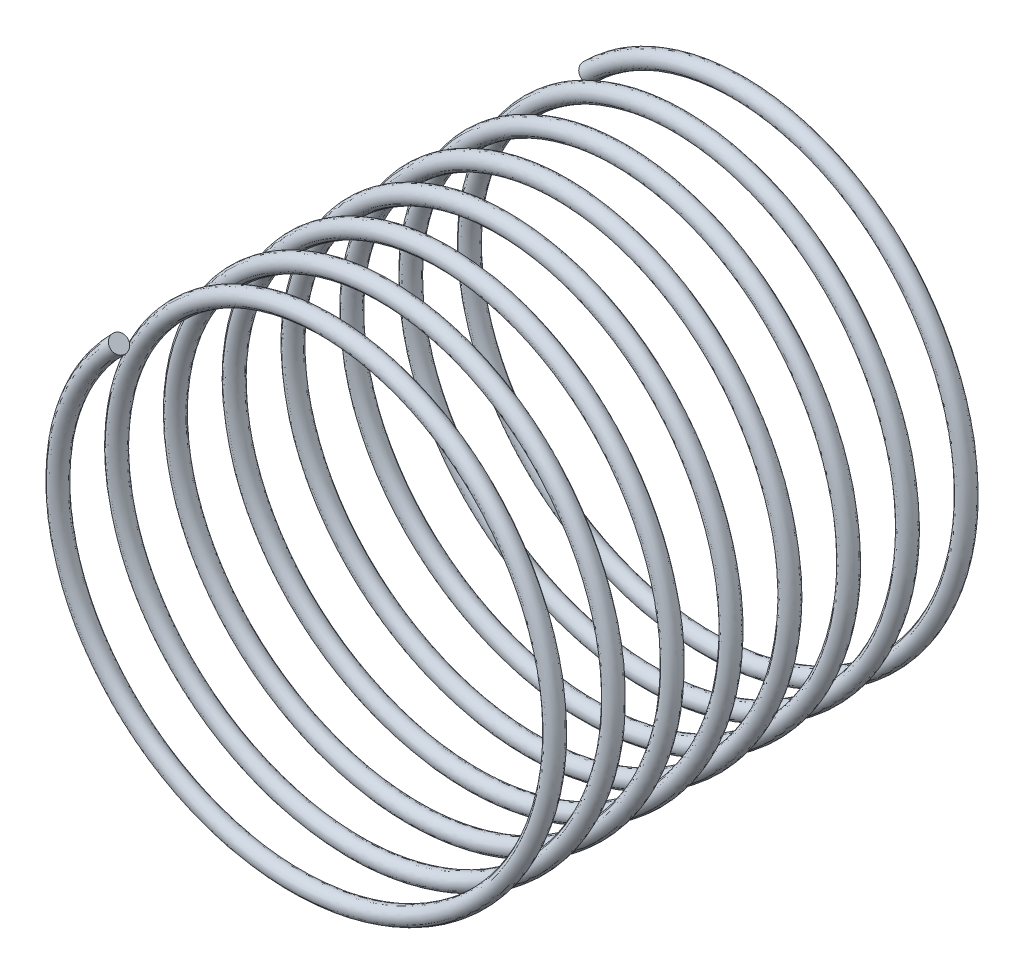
ISO-10303-21;
HEADER;
FILE_DESCRIPTION(('STEP AP214'),'2;1');
FILE_NAME('part.step','',(''),(''),'','','');
FILE_SCHEMA(('AUTOMOTIVE_DESIGN { 1 0 10303 214 1 1 1 1 }'));
ENDSEC;
DATA;
#1=APPLICATION_CONTEXT('core data for automotive mechanical design processes');
#2=APPLICATION_PROTOCOL_DEFINITION('international standard','automotive_design',2000,#1);
#3=PRODUCT_CONTEXT('',#1,'mechanical');
#4=PRODUCT('Part','Part','',(#3));
#5=PRODUCT_RELATED_PRODUCT_CATEGORY('part','',(#4));
#6=PRODUCT_DEFINITION_FORMATION('','',#4);
#7=PRODUCT_DEFINITION_CONTEXT('part definition',#1,'design');
#8=PRODUCT_DEFINITION('design','',#6,#7);
#9=PRODUCT_DEFINITION_SHAPE('','',#8);
#10=(LENGTH_UNIT() NAMED_UNIT(*) SI_UNIT(.MILLI.,.METRE.));
#11=(NAMED_UNIT(*) PLANE_ANGLE_UNIT() SI_UNIT($,.RADIAN.));
#12=(NAMED_UNIT(*) SI_UNIT($,.STERADIAN.) SOLID_ANGLE_UNIT());
#13=UNCERTAINTY_MEASURE_WITH_UNIT(LENGTH_MEASURE(1.E-05),#10,'distance_accuracy_value','');
#14=(GEOMETRIC_REPRESENTATION_CONTEXT(3) GLOBAL_UNCERTAINTY_ASSIGNED_CONTEXT((#13)) GLOBAL_UNIT_ASSIGNED_CONTEXT((#10,
#11,#12)) REPRESENTATION_CONTEXT('',''));
#15=CARTESIAN_POINT('',(0.,0.,0.));
#16=DIRECTION('',(0.,0.,1.));
#17=DIRECTION('',(1.,0.,0.));
#18=AXIS2_PLACEMENT_3D('',#15,#16,#17);
#19=CARTESIAN_POINT('',(-2.89913780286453,2.89913780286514,8.26000000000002));
#20=DIRECTION('',(0.70653951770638,0.706539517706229,0.0400477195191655));
#21=DIRECTION('',(-0.707106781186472,0.707106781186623,0.));
#22=AXIS2_PLACEMENT_3D('',#19,#20,#21);
#23=PLANE('',#22);
#24=CARTESIAN_POINT('',(-2.8991378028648,2.89913780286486,8.26000000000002));
#25=DIRECTION('',(0.706539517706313,0.706539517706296,0.0400477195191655));
#26=DIRECTION('',(-0.707106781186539,0.707106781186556,0.));
#27=AXIS2_PLACEMENT_3D('',#24,#25,#26);
#28=CIRCLE('',#27,0.150000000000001);
#29=CARTESIAN_POINT('',(-3.00520382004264,3.00520382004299,8.26000000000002));
#30=VERTEX_POINT('',#29);
#31=EDGE_CURVE('E40',#30,#30,#28,.T.);
#32=ORIENTED_EDGE('',*,*,#31,.T.);
#33=EDGE_LOOP('',(#32));
#34=FACE_BOUND('',#33,.T.);
#35=ADVANCED_FACE('F30',(#34),#23,.T.);
#36=CARTESIAN_POINT('',(-2.89913780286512,2.89913780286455,0.));
#37=DIRECTION('',(0.706539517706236,0.706539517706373,0.0400477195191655));
#38=DIRECTION('',(-0.707106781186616,0.707106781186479,0.));
#39=AXIS2_PLACEMENT_3D('',#36,#37,#38);
#40=PLANE('',#39);
#41=CARTESIAN_POINT('',(-2.89913780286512,2.89913780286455,0.));
#42=DIRECTION('',(0.706539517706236,0.706539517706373,0.0400477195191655));
#43=DIRECTION('',(-0.707106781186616,0.707106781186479,0.));
#44=AXIS2_PLACEMENT_3D('',#41,#42,#43);
#45=CIRCLE('',#44,0.150000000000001);
#46=CARTESIAN_POINT('',(-3.00520382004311,3.00520382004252,0.));
#47=VERTEX_POINT('',#46);
#48=EDGE_CURVE('E11',#47,#47,#45,.T.);
#49=ORIENTED_EDGE('',*,*,#48,.F.);
#50=EDGE_LOOP('',(#49));
#51=FACE_BOUND('',#50,.T.);
#52=ADVANCED_FACE('F48',(#51),#40,.F.);
#53=CARTESIAN_POINT('',(-3.00520382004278,3.00520382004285,8.26000000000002));
#54=CARTESIAN_POINT('',(-4.74025905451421,1.27014858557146,8.17395833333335));
#55=CARTESIAN_POINT('',(-4.10518476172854,-1.09998094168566,8.08791666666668));
#56=CARTESIAN_POINT('',(-3.47011046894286,-3.47011046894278,8.00187500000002));
#57=CARTESIAN_POINT('',(-1.09998094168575,-4.10518476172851,7.91583333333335));
#58=CARTESIAN_POINT('',(1.27014858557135,-4.74025905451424,7.82979166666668));
#59=CARTESIAN_POINT('',(3.00520382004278,-3.00520382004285,7.74375000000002));
#60=CARTESIAN_POINT('',(4.74025905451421,-1.27014858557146,7.65770833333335));
#61=CARTESIAN_POINT('',(4.10518476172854,1.09998094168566,7.57166666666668));
#62=CARTESIAN_POINT('',(3.47011046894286,3.47011046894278,7.48562500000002));
#63=CARTESIAN_POINT('',(1.09998094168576,4.10518476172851,7.39958333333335));
#64=CARTESIAN_POINT('',(-1.27014858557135,4.74025905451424,7.31354166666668));
#65=CARTESIAN_POINT('',(-3.00520382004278,3.00520382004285,7.22750000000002));
#66=CARTESIAN_POINT('',(-4.74025905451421,1.27014858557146,7.14145833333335));
#67=CARTESIAN_POINT('',(-4.10518476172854,-1.09998094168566,7.05541666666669));
#68=CARTESIAN_POINT('',(-3.47011046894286,-3.47011046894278,6.96937500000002));
#69=CARTESIAN_POINT('',(-1.09998094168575,-4.10518476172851,6.88333333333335));
#70=CARTESIAN_POINT('',(1.27014858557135,-4.74025905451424,6.79729166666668));
#71=CARTESIAN_POINT('',(3.00520382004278,-3.00520382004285,6.71125000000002));
#72=CARTESIAN_POINT('',(4.74025905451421,-1.27014858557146,6.62520833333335));
#73=CARTESIAN_POINT('',(4.10518476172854,1.09998094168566,6.53916666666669));
#74=CARTESIAN_POINT('',(3.47011046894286,3.47011046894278,6.45312500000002));
#75=CARTESIAN_POINT('',(1.09998094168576,4.10518476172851,6.36708333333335));
#76=CARTESIAN_POINT('',(-1.27014858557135,4.74025905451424,6.28104166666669));
#77=CARTESIAN_POINT('',(-3.00520382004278,3.00520382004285,6.19500000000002));
#78=CARTESIAN_POINT('',(-4.74025905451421,1.27014858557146,6.10895833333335));
#79=CARTESIAN_POINT('',(-4.10518476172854,-1.09998094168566,6.02291666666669));
#80=CARTESIAN_POINT('',(-3.47011046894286,-3.47011046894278,5.93687500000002));
#81=CARTESIAN_POINT('',(-1.09998094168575,-4.10518476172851,5.85083333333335));
#82=CARTESIAN_POINT('',(1.27014858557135,-4.74025905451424,5.76479166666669));
#83=CARTESIAN_POINT('',(3.00520382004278,-3.00520382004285,5.67875000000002));
#84=CARTESIAN_POINT('',(4.74025905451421,-1.27014858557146,5.59270833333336));
#85=CARTESIAN_POINT('',(4.10518476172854,1.09998094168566,5.50666666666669));
#86=CARTESIAN_POINT('',(3.47011046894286,3.47011046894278,5.42062500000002));
#87=CARTESIAN_POINT('',(1.09998094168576,4.10518476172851,5.33458333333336));
#88=CARTESIAN_POINT('',(-1.27014858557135,4.74025905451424,5.24854166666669));
#89=CARTESIAN_POINT('',(-3.00520382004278,3.00520382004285,5.16250000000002));
#90=CARTESIAN_POINT('',(-4.74025905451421,1.27014858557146,5.07645833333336));
#91=CARTESIAN_POINT('',(-4.10518476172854,-1.09998094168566,4.99041666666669));
#92=CARTESIAN_POINT('',(-3.47011046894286,-3.47011046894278,4.90437500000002));
#93=CARTESIAN_POINT('',(-1.09998094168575,-4.10518476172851,4.81833333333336));
#94=CARTESIAN_POINT('',(1.27014858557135,-4.74025905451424,4.73229166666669));
#95=CARTESIAN_POINT('',(3.00520382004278,-3.00520382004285,4.64625000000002));
#96=CARTESIAN_POINT('',(4.74025905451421,-1.27014858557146,4.56020833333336));
#97=CARTESIAN_POINT('',(4.10518476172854,1.09998094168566,4.47416666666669));
#98=CARTESIAN_POINT('',(3.47011046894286,3.47011046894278,4.38812500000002));
#99=CARTESIAN_POINT('',(1.09998094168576,4.10518476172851,4.30208333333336));
#100=CARTESIAN_POINT('',(-1.27014858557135,4.74025905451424,4.21604166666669));
#101=CARTESIAN_POINT('',(-3.00520382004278,3.00520382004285,4.13000000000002));
#102=CARTESIAN_POINT('',(-4.74025905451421,1.27014858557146,4.04395833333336));
#103=CARTESIAN_POINT('',(-4.10518476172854,-1.09998094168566,3.95791666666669));
#104=CARTESIAN_POINT('',(-3.47011046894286,-3.47011046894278,3.87187500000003));
#105=CARTESIAN_POINT('',(-1.09998094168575,-4.10518476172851,3.78583333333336));
#106=CARTESIAN_POINT('',(1.27014858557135,-4.74025905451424,3.69979166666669));
#107=CARTESIAN_POINT('',(3.00520382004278,-3.00520382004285,3.61375000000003));
#108=CARTESIAN_POINT('',(4.74025905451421,-1.27014858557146,3.52770833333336));
#109=CARTESIAN_POINT('',(4.10518476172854,1.09998094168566,3.44166666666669));
#110=CARTESIAN_POINT('',(3.47011046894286,3.47011046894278,3.35562500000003));
#111=CARTESIAN_POINT('',(1.09998094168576,4.10518476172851,3.26958333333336));
#112=CARTESIAN_POINT('',(-1.27014858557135,4.74025905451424,3.18354166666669));
#113=CARTESIAN_POINT('',(-3.00520382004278,3.00520382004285,3.09750000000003));
#114=CARTESIAN_POINT('',(-4.74025905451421,1.27014858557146,3.01145833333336));
#115=CARTESIAN_POINT('',(-4.10518476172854,-1.09998094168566,2.92541666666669));
#116=CARTESIAN_POINT('',(-3.47011046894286,-3.47011046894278,2.83937500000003));
#117=CARTESIAN_POINT('',(-1.09998094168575,-4.10518476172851,2.75333333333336));
#118=CARTESIAN_POINT('',(1.27014858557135,-4.74025905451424,2.6672916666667));
#119=CARTESIAN_POINT('',(3.00520382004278,-3.00520382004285,2.58125000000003));
#120=CARTESIAN_POINT('',(4.74025905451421,-1.27014858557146,2.49520833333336));
#121=CARTESIAN_POINT('',(4.10518476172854,1.09998094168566,2.4091666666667));
#122=CARTESIAN_POINT('',(3.47011046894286,3.47011046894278,2.32312500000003));
#123=CARTESIAN_POINT('',(1.09998094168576,4.10518476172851,2.23708333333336));
#124=CARTESIAN_POINT('',(-1.27014858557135,4.74025905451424,2.1510416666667));
#125=CARTESIAN_POINT('',(-3.00520382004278,3.00520382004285,2.06500000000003));
#126=CARTESIAN_POINT('',(-4.74025905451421,1.27014858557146,1.97895833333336));
#127=CARTESIAN_POINT('',(-4.10518476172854,-1.09998094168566,1.8929166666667));
#128=CARTESIAN_POINT('',(-3.47011046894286,-3.47011046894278,1.80687500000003));
#129=CARTESIAN_POINT('',(-1.09998094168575,-4.10518476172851,1.72083333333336));
#130=CARTESIAN_POINT('',(1.27014858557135,-4.74025905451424,1.6347916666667));
#131=CARTESIAN_POINT('',(3.00520382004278,-3.00520382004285,1.54875000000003));
#132=CARTESIAN_POINT('',(4.74025905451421,-1.27014858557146,1.46270833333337));
#133=CARTESIAN_POINT('',(4.10518476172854,1.09998094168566,1.3766666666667));
#134=CARTESIAN_POINT('',(3.47011046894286,3.47011046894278,1.29062500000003));
#135=CARTESIAN_POINT('',(1.09998094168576,4.10518476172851,1.20458333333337));
#136=CARTESIAN_POINT('',(-1.27014858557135,4.74025905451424,1.1185416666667));
#137=CARTESIAN_POINT('',(-3.00520382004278,3.00520382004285,1.03250000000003));
#138=CARTESIAN_POINT('',(-4.74025905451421,1.27014858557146,0.946458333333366));
#139=CARTESIAN_POINT('',(-4.10518476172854,-1.09998094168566,0.860416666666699));
#140=CARTESIAN_POINT('',(-3.47011046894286,-3.47011046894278,0.774375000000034));
#141=CARTESIAN_POINT('',(-1.09998094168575,-4.10518476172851,0.688333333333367));
#142=CARTESIAN_POINT('',(1.27014858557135,-4.74025905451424,0.602291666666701));
#143=CARTESIAN_POINT('',(3.00520382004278,-3.00520382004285,0.516250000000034));
#144=CARTESIAN_POINT('',(4.74025905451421,-1.27014858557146,0.430208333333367));
#145=CARTESIAN_POINT('',(4.10518476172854,1.09998094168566,0.344166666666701));
#146=CARTESIAN_POINT('',(3.47011046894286,3.47011046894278,0.258125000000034));
#147=CARTESIAN_POINT('',(1.09998094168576,4.10518476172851,0.172083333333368));
#148=CARTESIAN_POINT('',(-1.27014858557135,4.74025905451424,0.0860416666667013));
#149=CARTESIAN_POINT('',(-3.00520382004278,3.00520382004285,0.));
#150=CARTESIAN_POINT('',(-4.74025905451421,1.27014858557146,-0.0860416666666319));
#151=CARTESIAN_POINT('',(-4.10518476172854,-1.09998094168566,-0.172083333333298));
#152=CARTESIAN_POINT('',(-3.47011046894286,-3.47011046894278,-0.258124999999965));
#153=CARTESIAN_POINT('',(-1.09998094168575,-4.10518476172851,-0.344166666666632));
#154=CARTESIAN_POINT('',(1.27014858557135,-4.74025905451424,-0.430208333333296));
#155=CARTESIAN_POINT('',(3.00520382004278,-3.00520382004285,-0.516249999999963));
#156=CARTESIAN_POINT('',(4.74025905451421,-1.27014858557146,-0.602291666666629));
#157=CARTESIAN_POINT('',(4.10518476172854,1.09998094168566,-0.688333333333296));
#158=CARTESIAN_POINT('',(3.47011046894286,3.47011046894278,-0.774374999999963));
#159=CARTESIAN_POINT('',(1.09998094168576,4.10518476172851,-0.860416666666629));
#160=CARTESIAN_POINT('',(-1.27014858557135,4.74025905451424,-0.946458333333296));
#161=CARTESIAN_POINT('',(-3.00520382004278,3.00520382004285,-1.03249999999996));
#162=CARTESIAN_POINT('',(-3.0136992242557,2.99670841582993,8.55975933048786));
#163=CARTESIAN_POINT('',(-4.74384963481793,1.25674835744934,8.47371766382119));
#164=CARTESIAN_POINT('',(-4.10207522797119,-1.11158587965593,8.38767599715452));
#165=CARTESIAN_POINT('',(-3.46030082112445,-3.47992011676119,8.30163433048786));
#166=CARTESIAN_POINT('',(-1.08837600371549,-4.10829429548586,8.21559266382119));
#167=CARTESIAN_POINT('',(1.28354881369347,-4.73666847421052,8.12955099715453));
#168=CARTESIAN_POINT('',(3.0136992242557,-2.99670841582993,8.04350933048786));
#169=CARTESIAN_POINT('',(4.74384963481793,-1.25674835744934,7.95746766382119));
#170=CARTESIAN_POINT('',(4.10207522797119,1.11158587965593,7.87142599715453));
#171=CARTESIAN_POINT('',(3.46030082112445,3.47992011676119,7.78538433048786));
#172=CARTESIAN_POINT('',(1.08837600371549,4.10829429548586,7.69934266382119));
#173=CARTESIAN_POINT('',(-1.28354881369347,4.73666847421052,7.61330099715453));
#174=CARTESIAN_POINT('',(-3.0136992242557,2.99670841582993,7.52725933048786));
#175=CARTESIAN_POINT('',(-4.74384963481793,1.25674835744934,7.4412176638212));
#176=CARTESIAN_POINT('',(-4.10207522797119,-1.11158587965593,7.35517599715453));
#177=CARTESIAN_POINT('',(-3.46030082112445,-3.47992011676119,7.26913433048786));
#178=CARTESIAN_POINT('',(-1.08837600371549,-4.10829429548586,7.1830926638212));
#179=CARTESIAN_POINT('',(1.28354881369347,-4.73666847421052,7.09705099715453));
#180=CARTESIAN_POINT('',(3.0136992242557,-2.99670841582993,7.01100933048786));
#181=CARTESIAN_POINT('',(4.74384963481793,-1.25674835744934,6.9249676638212));
#182=CARTESIAN_POINT('',(4.10207522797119,1.11158587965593,6.83892599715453));
#183=CARTESIAN_POINT('',(3.46030082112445,3.47992011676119,6.75288433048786));
#184=CARTESIAN_POINT('',(1.08837600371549,4.10829429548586,6.6668426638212));
#185=CARTESIAN_POINT('',(-1.28354881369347,4.73666847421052,6.58080099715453));
#186=CARTESIAN_POINT('',(-3.0136992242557,2.99670841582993,6.49475933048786));
#187=CARTESIAN_POINT('',(-4.74384963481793,1.25674835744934,6.4087176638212));
#188=CARTESIAN_POINT('',(-4.10207522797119,-1.11158587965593,6.32267599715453));
#189=CARTESIAN_POINT('',(-3.46030082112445,-3.47992011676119,6.23663433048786));
#190=CARTESIAN_POINT('',(-1.08837600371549,-4.10829429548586,6.1505926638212));
#191=CARTESIAN_POINT('',(1.28354881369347,-4.73666847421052,6.06455099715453));
#192=CARTESIAN_POINT('',(3.0136992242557,-2.99670841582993,5.97850933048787));
#193=CARTESIAN_POINT('',(4.74384963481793,-1.25674835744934,5.8924676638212));
#194=CARTESIAN_POINT('',(4.10207522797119,1.11158587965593,5.80642599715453));
#195=CARTESIAN_POINT('',(3.46030082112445,3.47992011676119,5.72038433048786));
#196=CARTESIAN_POINT('',(1.08837600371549,4.10829429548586,5.6343426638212));
#197=CARTESIAN_POINT('',(-1.28354881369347,4.73666847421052,5.54830099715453));
#198=CARTESIAN_POINT('',(-3.0136992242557,2.99670841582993,5.46225933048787));
#199=CARTESIAN_POINT('',(-4.74384963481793,1.25674835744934,5.3762176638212));
#200=CARTESIAN_POINT('',(-4.10207522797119,-1.11158587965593,5.29017599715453));
#201=CARTESIAN_POINT('',(-3.46030082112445,-3.47992011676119,5.20413433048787));
#202=CARTESIAN_POINT('',(-1.08837600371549,-4.10829429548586,5.1180926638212));
#203=CARTESIAN_POINT('',(1.28354881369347,-4.73666847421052,5.03205099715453));
#204=CARTESIAN_POINT('',(3.0136992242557,-2.99670841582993,4.94600933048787));
#205=CARTESIAN_POINT('',(4.74384963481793,-1.25674835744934,4.8599676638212));
#206=CARTESIAN_POINT('',(4.10207522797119,1.11158587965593,4.77392599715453));
#207=CARTESIAN_POINT('',(3.46030082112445,3.47992011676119,4.68788433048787));
#208=CARTESIAN_POINT('',(1.08837600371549,4.10829429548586,4.6018426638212));
#209=CARTESIAN_POINT('',(-1.28354881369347,4.73666847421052,4.51580099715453));
#210=CARTESIAN_POINT('',(-3.0136992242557,2.99670841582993,4.42975933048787));
#211=CARTESIAN_POINT('',(-4.74384963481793,1.25674835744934,4.3437176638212));
#212=CARTESIAN_POINT('',(-4.10207522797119,-1.11158587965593,4.25767599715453));
#213=CARTESIAN_POINT('',(-3.46030082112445,-3.47992011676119,4.17163433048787));
#214=CARTESIAN_POINT('',(-1.08837600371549,-4.10829429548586,4.0855926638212));
#215=CARTESIAN_POINT('',(1.28354881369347,-4.73666847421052,3.99955099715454));
#216=CARTESIAN_POINT('',(3.0136992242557,-2.99670841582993,3.91350933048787));
#217=CARTESIAN_POINT('',(4.74384963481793,-1.25674835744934,3.8274676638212));
#218=CARTESIAN_POINT('',(4.10207522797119,1.11158587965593,3.74142599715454));
#219=CARTESIAN_POINT('',(3.46030082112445,3.47992011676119,3.65538433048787));
#220=CARTESIAN_POINT('',(1.08837600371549,4.10829429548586,3.5693426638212));
#221=CARTESIAN_POINT('',(-1.28354881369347,4.73666847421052,3.48330099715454));
#222=CARTESIAN_POINT('',(-3.0136992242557,2.99670841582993,3.39725933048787));
#223=CARTESIAN_POINT('',(-4.74384963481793,1.25674835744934,3.3112176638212));
#224=CARTESIAN_POINT('',(-4.10207522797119,-1.11158587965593,3.22517599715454));
#225=CARTESIAN_POINT('',(-3.46030082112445,-3.47992011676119,3.13913433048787));
#226=CARTESIAN_POINT('',(-1.08837600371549,-4.10829429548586,3.0530926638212));
#227=CARTESIAN_POINT('',(1.28354881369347,-4.73666847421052,2.96705099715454));
#228=CARTESIAN_POINT('',(3.0136992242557,-2.99670841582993,2.88100933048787));
#229=CARTESIAN_POINT('',(4.74384963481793,-1.25674835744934,2.7949676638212));
#230=CARTESIAN_POINT('',(4.10207522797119,1.11158587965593,2.70892599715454));
#231=CARTESIAN_POINT('',(3.46030082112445,3.47992011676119,2.62288433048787));
#232=CARTESIAN_POINT('',(1.08837600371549,4.10829429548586,2.53684266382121));
#233=CARTESIAN_POINT('',(-1.28354881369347,4.73666847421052,2.45080099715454));
#234=CARTESIAN_POINT('',(-3.0136992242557,2.99670841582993,2.36475933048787));
#235=CARTESIAN_POINT('',(-4.74384963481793,1.25674835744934,2.27871766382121));
#236=CARTESIAN_POINT('',(-4.10207522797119,-1.11158587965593,2.19267599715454));
#237=CARTESIAN_POINT('',(-3.46030082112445,-3.47992011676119,2.10663433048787));
#238=CARTESIAN_POINT('',(-1.08837600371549,-4.10829429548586,2.02059266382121));
#239=CARTESIAN_POINT('',(1.28354881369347,-4.73666847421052,1.93455099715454));
#240=CARTESIAN_POINT('',(3.0136992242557,-2.99670841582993,1.84850933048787));
#241=CARTESIAN_POINT('',(4.74384963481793,-1.25674835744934,1.76246766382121));
#242=CARTESIAN_POINT('',(4.10207522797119,1.11158587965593,1.67642599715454));
#243=CARTESIAN_POINT('',(3.46030082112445,3.47992011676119,1.59038433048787));
#244=CARTESIAN_POINT('',(1.08837600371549,4.10829429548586,1.50434266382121));
#245=CARTESIAN_POINT('',(-1.28354881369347,4.73666847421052,1.41830099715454));
#246=CARTESIAN_POINT('',(-3.0136992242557,2.99670841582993,1.33225933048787));
#247=CARTESIAN_POINT('',(-4.74384963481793,1.25674835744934,1.24621766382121));
#248=CARTESIAN_POINT('',(-4.10207522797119,-1.11158587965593,1.16017599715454));
#249=CARTESIAN_POINT('',(-3.46030082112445,-3.47992011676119,1.07413433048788));
#250=CARTESIAN_POINT('',(-1.08837600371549,-4.10829429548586,0.988092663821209));
#251=CARTESIAN_POINT('',(1.28354881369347,-4.73666847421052,0.902050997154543));
#252=CARTESIAN_POINT('',(3.0136992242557,-2.99670841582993,0.816009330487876));
#253=CARTESIAN_POINT('',(4.74384963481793,-1.25674835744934,0.72996766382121));
#254=CARTESIAN_POINT('',(4.10207522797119,1.11158587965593,0.643925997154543));
#255=CARTESIAN_POINT('',(3.46030082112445,3.47992011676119,0.557884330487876));
#256=CARTESIAN_POINT('',(1.08837600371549,4.10829429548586,0.47184266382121));
#257=CARTESIAN_POINT('',(-1.28354881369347,4.73666847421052,0.385800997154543));
#258=CARTESIAN_POINT('',(-3.0136992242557,2.99670841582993,0.299759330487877));
#259=CARTESIAN_POINT('',(-4.74384963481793,1.25674835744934,0.21371766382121));
#260=CARTESIAN_POINT('',(-4.10207522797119,-1.11158587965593,0.127675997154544));
#261=CARTESIAN_POINT('',(-3.46030082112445,-3.47992011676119,0.0416343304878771));
#262=CARTESIAN_POINT('',(-1.08837600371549,-4.10829429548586,-0.0444073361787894));
#263=CARTESIAN_POINT('',(1.28354881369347,-4.73666847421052,-0.130449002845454));
#264=CARTESIAN_POINT('',(3.0136992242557,-2.99670841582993,-0.216490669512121));
#265=CARTESIAN_POINT('',(4.74384963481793,-1.25674835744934,-0.302532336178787));
#266=CARTESIAN_POINT('',(4.10207522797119,1.11158587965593,-0.388574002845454));
#267=CARTESIAN_POINT('',(3.46030082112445,3.47992011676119,-0.474615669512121));
#268=CARTESIAN_POINT('',(1.08837600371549,4.10829429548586,-0.560657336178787));
#269=CARTESIAN_POINT('',(-1.28354881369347,4.73666847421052,-0.646699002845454));
#270=CARTESIAN_POINT('',(-3.0136992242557,2.99670841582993,-0.73274066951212));
#271=CARTESIAN_POINT('',(-2.80156718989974,2.78457638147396,8.55975933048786));
#272=CARTESIAN_POINT('',(-4.4092431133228,1.16709081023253,8.47371766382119));
#273=CARTESIAN_POINT('',(-3.81229748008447,-1.03394016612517,8.38767599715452));
#274=CARTESIAN_POINT('',(-3.21535184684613,-3.23497114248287,8.30163433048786));
#275=CARTESIAN_POINT('',(-1.01073029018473,-3.81851654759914,8.21559266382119));
#276=CARTESIAN_POINT('',(1.19389126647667,-4.4020619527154,8.12955099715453));
#277=CARTESIAN_POINT('',(2.80156718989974,-2.78457638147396,8.04350933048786));
#278=CARTESIAN_POINT('',(4.4092431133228,-1.16709081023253,7.95746766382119));
#279=CARTESIAN_POINT('',(3.81229748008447,1.03394016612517,7.87142599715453));
#280=CARTESIAN_POINT('',(3.21535184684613,3.23497114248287,7.78538433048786));
#281=CARTESIAN_POINT('',(1.01073029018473,3.81851654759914,7.69934266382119));
#282=CARTESIAN_POINT('',(-1.19389126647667,4.4020619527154,7.61330099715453));
#283=CARTESIAN_POINT('',(-2.80156718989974,2.78457638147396,7.52725933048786));
#284=CARTESIAN_POINT('',(-4.4092431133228,1.16709081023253,7.4412176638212));
#285=CARTESIAN_POINT('',(-3.81229748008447,-1.03394016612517,7.35517599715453));
#286=CARTESIAN_POINT('',(-3.21535184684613,-3.23497114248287,7.26913433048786));
#287=CARTESIAN_POINT('',(-1.01073029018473,-3.81851654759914,7.1830926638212));
#288=CARTESIAN_POINT('',(1.19389126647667,-4.4020619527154,7.09705099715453));
#289=CARTESIAN_POINT('',(2.80156718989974,-2.78457638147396,7.01100933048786));
#290=CARTESIAN_POINT('',(4.4092431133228,-1.16709081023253,6.9249676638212));
#291=CARTESIAN_POINT('',(3.81229748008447,1.03394016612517,6.83892599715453));
#292=CARTESIAN_POINT('',(3.21535184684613,3.23497114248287,6.75288433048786));
#293=CARTESIAN_POINT('',(1.01073029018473,3.81851654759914,6.6668426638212));
#294=CARTESIAN_POINT('',(-1.19389126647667,4.4020619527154,6.58080099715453));
#295=CARTESIAN_POINT('',(-2.80156718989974,2.78457638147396,6.49475933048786));
#296=CARTESIAN_POINT('',(-4.4092431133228,1.16709081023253,6.4087176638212));
#297=CARTESIAN_POINT('',(-3.81229748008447,-1.03394016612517,6.32267599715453));
#298=CARTESIAN_POINT('',(-3.21535184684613,-3.23497114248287,6.23663433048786));
#299=CARTESIAN_POINT('',(-1.01073029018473,-3.81851654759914,6.1505926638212));
#300=CARTESIAN_POINT('',(1.19389126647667,-4.4020619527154,6.06455099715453));
#301=CARTESIAN_POINT('',(2.80156718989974,-2.78457638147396,5.97850933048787));
#302=CARTESIAN_POINT('',(4.4092431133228,-1.16709081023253,5.8924676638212));
#303=CARTESIAN_POINT('',(3.81229748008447,1.03394016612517,5.80642599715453));
#304=CARTESIAN_POINT('',(3.21535184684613,3.23497114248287,5.72038433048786));
#305=CARTESIAN_POINT('',(1.01073029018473,3.81851654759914,5.6343426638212));
#306=CARTESIAN_POINT('',(-1.19389126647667,4.4020619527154,5.54830099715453));
#307=CARTESIAN_POINT('',(-2.80156718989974,2.78457638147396,5.46225933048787));
#308=CARTESIAN_POINT('',(-4.4092431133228,1.16709081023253,5.3762176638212));
#309=CARTESIAN_POINT('',(-3.81229748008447,-1.03394016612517,5.29017599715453));
#310=CARTESIAN_POINT('',(-3.21535184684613,-3.23497114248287,5.20413433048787));
#311=CARTESIAN_POINT('',(-1.01073029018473,-3.81851654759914,5.1180926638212));
#312=CARTESIAN_POINT('',(1.19389126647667,-4.4020619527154,5.03205099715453));
#313=CARTESIAN_POINT('',(2.80156718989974,-2.78457638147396,4.94600933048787));
#314=CARTESIAN_POINT('',(4.4092431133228,-1.16709081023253,4.8599676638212));
#315=CARTESIAN_POINT('',(3.81229748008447,1.03394016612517,4.77392599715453));
#316=CARTESIAN_POINT('',(3.21535184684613,3.23497114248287,4.68788433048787));
#317=CARTESIAN_POINT('',(1.01073029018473,3.81851654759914,4.6018426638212));
#318=CARTESIAN_POINT('',(-1.19389126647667,4.4020619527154,4.51580099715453));
#319=CARTESIAN_POINT('',(-2.80156718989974,2.78457638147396,4.42975933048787));
#320=CARTESIAN_POINT('',(-4.4092431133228,1.16709081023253,4.3437176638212));
#321=CARTESIAN_POINT('',(-3.81229748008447,-1.03394016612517,4.25767599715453));
#322=CARTESIAN_POINT('',(-3.21535184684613,-3.23497114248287,4.17163433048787));
#323=CARTESIAN_POINT('',(-1.01073029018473,-3.81851654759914,4.0855926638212));
#324=CARTESIAN_POINT('',(1.19389126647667,-4.4020619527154,3.99955099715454));
#325=CARTESIAN_POINT('',(2.80156718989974,-2.78457638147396,3.91350933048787));
#326=CARTESIAN_POINT('',(4.4092431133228,-1.16709081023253,3.8274676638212));
#327=CARTESIAN_POINT('',(3.81229748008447,1.03394016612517,3.74142599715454));
#328=CARTESIAN_POINT('',(3.21535184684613,3.23497114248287,3.65538433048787));
#329=CARTESIAN_POINT('',(1.01073029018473,3.81851654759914,3.5693426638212));
#330=CARTESIAN_POINT('',(-1.19389126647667,4.4020619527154,3.48330099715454));
#331=CARTESIAN_POINT('',(-2.80156718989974,2.78457638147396,3.39725933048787));
#332=CARTESIAN_POINT('',(-4.4092431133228,1.16709081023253,3.3112176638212));
#333=CARTESIAN_POINT('',(-3.81229748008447,-1.03394016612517,3.22517599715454));
#334=CARTESIAN_POINT('',(-3.21535184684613,-3.23497114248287,3.13913433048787));
#335=CARTESIAN_POINT('',(-1.01073029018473,-3.81851654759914,3.0530926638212));
#336=CARTESIAN_POINT('',(1.19389126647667,-4.4020619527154,2.96705099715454));
#337=CARTESIAN_POINT('',(2.80156718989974,-2.78457638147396,2.88100933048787));
#338=CARTESIAN_POINT('',(4.4092431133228,-1.16709081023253,2.7949676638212));
#339=CARTESIAN_POINT('',(3.81229748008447,1.03394016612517,2.70892599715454));
#340=CARTESIAN_POINT('',(3.21535184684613,3.23497114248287,2.62288433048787));
#341=CARTESIAN_POINT('',(1.01073029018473,3.81851654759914,2.53684266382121));
#342=CARTESIAN_POINT('',(-1.19389126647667,4.4020619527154,2.45080099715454));
#343=CARTESIAN_POINT('',(-2.80156718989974,2.78457638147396,2.36475933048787));
#344=CARTESIAN_POINT('',(-4.4092431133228,1.16709081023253,2.27871766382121));
#345=CARTESIAN_POINT('',(-3.81229748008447,-1.03394016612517,2.19267599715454));
#346=CARTESIAN_POINT('',(-3.21535184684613,-3.23497114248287,2.10663433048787));
#347=CARTESIAN_POINT('',(-1.01073029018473,-3.81851654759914,2.02059266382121));
#348=CARTESIAN_POINT('',(1.19389126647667,-4.4020619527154,1.93455099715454));
#349=CARTESIAN_POINT('',(2.80156718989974,-2.78457638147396,1.84850933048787));
#350=CARTESIAN_POINT('',(4.4092431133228,-1.16709081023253,1.76246766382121));
#351=CARTESIAN_POINT('',(3.81229748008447,1.03394016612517,1.67642599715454));
#352=CARTESIAN_POINT('',(3.21535184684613,3.23497114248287,1.59038433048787));
#353=CARTESIAN_POINT('',(1.01073029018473,3.81851654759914,1.50434266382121));
#354=CARTESIAN_POINT('',(-1.19389126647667,4.4020619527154,1.41830099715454));
#355=CARTESIAN_POINT('',(-2.80156718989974,2.78457638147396,1.33225933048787));
#356=CARTESIAN_POINT('',(-4.4092431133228,1.16709081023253,1.24621766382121));
#357=CARTESIAN_POINT('',(-3.81229748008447,-1.03394016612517,1.16017599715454));
#358=CARTESIAN_POINT('',(-3.21535184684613,-3.23497114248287,1.07413433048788));
#359=CARTESIAN_POINT('',(-1.01073029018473,-3.81851654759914,0.988092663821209));
#360=CARTESIAN_POINT('',(1.19389126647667,-4.4020619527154,0.902050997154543));
#361=CARTESIAN_POINT('',(2.80156718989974,-2.78457638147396,0.816009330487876));
#362=CARTESIAN_POINT('',(4.4092431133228,-1.16709081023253,0.72996766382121));
#363=CARTESIAN_POINT('',(3.81229748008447,1.03394016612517,0.643925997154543));
#364=CARTESIAN_POINT('',(3.21535184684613,3.23497114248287,0.557884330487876));
#365=CARTESIAN_POINT('',(1.01073029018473,3.81851654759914,0.47184266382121));
#366=CARTESIAN_POINT('',(-1.19389126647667,4.4020619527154,0.385800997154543));
#367=CARTESIAN_POINT('',(-2.80156718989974,2.78457638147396,0.299759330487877));
#368=CARTESIAN_POINT('',(-4.4092431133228,1.16709081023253,0.21371766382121));
#369=CARTESIAN_POINT('',(-3.81229748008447,-1.03394016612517,0.127675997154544));
#370=CARTESIAN_POINT('',(-3.21535184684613,-3.23497114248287,0.0416343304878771));
#371=CARTESIAN_POINT('',(-1.01073029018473,-3.81851654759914,-0.0444073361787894));
#372=CARTESIAN_POINT('',(1.19389126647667,-4.4020619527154,-0.130449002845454));
#373=CARTESIAN_POINT('',(2.80156718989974,-2.78457638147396,-0.216490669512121));
#374=CARTESIAN_POINT('',(4.4092431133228,-1.16709081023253,-0.302532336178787));
#375=CARTESIAN_POINT('',(3.81229748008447,1.03394016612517,-0.388574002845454));
#376=CARTESIAN_POINT('',(3.21535184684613,3.23497114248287,-0.474615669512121));
#377=CARTESIAN_POINT('',(1.01073029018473,3.81851654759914,-0.560657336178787));
#378=CARTESIAN_POINT('',(-1.19389126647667,4.4020619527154,-0.646699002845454));
#379=CARTESIAN_POINT('',(-2.80156718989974,2.78457638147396,-0.73274066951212));
#380=CARTESIAN_POINT('',(-2.79307178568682,2.79307178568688,8.26000000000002));
#381=CARTESIAN_POINT('',(-4.40565253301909,1.18049103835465,8.17395833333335));
#382=CARTESIAN_POINT('',(-3.81540701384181,-1.02233522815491,8.08791666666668));
#383=CARTESIAN_POINT('',(-3.22516149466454,-3.22516149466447,8.00187500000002));
#384=CARTESIAN_POINT('',(-1.02233522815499,-3.81540701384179,7.91583333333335));
#385=CARTESIAN_POINT('',(1.18049103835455,-4.40565253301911,7.82979166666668));
#386=CARTESIAN_POINT('',(2.79307178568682,-2.79307178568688,7.74375000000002));
#387=CARTESIAN_POINT('',(4.40565253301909,-1.18049103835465,7.65770833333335));
#388=CARTESIAN_POINT('',(3.81540701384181,1.02233522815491,7.57166666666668));
#389=CARTESIAN_POINT('',(3.22516149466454,3.22516149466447,7.48562500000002));
#390=CARTESIAN_POINT('',(1.022335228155,3.81540701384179,7.39958333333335));
#391=CARTESIAN_POINT('',(-1.18049103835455,4.40565253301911,7.31354166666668));
#392=CARTESIAN_POINT('',(-2.79307178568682,2.79307178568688,7.22750000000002));
#393=CARTESIAN_POINT('',(-4.40565253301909,1.18049103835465,7.14145833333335));
#394=CARTESIAN_POINT('',(-3.81540701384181,-1.02233522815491,7.05541666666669));
#395=CARTESIAN_POINT('',(-3.22516149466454,-3.22516149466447,6.96937500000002));
#396=CARTESIAN_POINT('',(-1.02233522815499,-3.81540701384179,6.88333333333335));
#397=CARTESIAN_POINT('',(1.18049103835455,-4.40565253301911,6.79729166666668));
#398=CARTESIAN_POINT('',(2.79307178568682,-2.79307178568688,6.71125000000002));
#399=CARTESIAN_POINT('',(4.40565253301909,-1.18049103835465,6.62520833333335));
#400=CARTESIAN_POINT('',(3.81540701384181,1.02233522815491,6.53916666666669));
#401=CARTESIAN_POINT('',(3.22516149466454,3.22516149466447,6.45312500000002));
#402=CARTESIAN_POINT('',(1.022335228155,3.81540701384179,6.36708333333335));
#403=CARTESIAN_POINT('',(-1.18049103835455,4.40565253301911,6.28104166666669));
#404=CARTESIAN_POINT('',(-2.79307178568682,2.79307178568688,6.19500000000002));
#405=CARTESIAN_POINT('',(-4.40565253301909,1.18049103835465,6.10895833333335));
#406=CARTESIAN_POINT('',(-3.81540701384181,-1.02233522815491,6.02291666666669));
#407=CARTESIAN_POINT('',(-3.22516149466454,-3.22516149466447,5.93687500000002));
#408=CARTESIAN_POINT('',(-1.02233522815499,-3.81540701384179,5.85083333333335));
#409=CARTESIAN_POINT('',(1.18049103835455,-4.40565253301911,5.76479166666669));
#410=CARTESIAN_POINT('',(2.79307178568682,-2.79307178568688,5.67875000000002));
#411=CARTESIAN_POINT('',(4.40565253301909,-1.18049103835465,5.59270833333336));
#412=CARTESIAN_POINT('',(3.81540701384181,1.02233522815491,5.50666666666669));
#413=CARTESIAN_POINT('',(3.22516149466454,3.22516149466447,5.42062500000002));
#414=CARTESIAN_POINT('',(1.022335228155,3.81540701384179,5.33458333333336));
#415=CARTESIAN_POINT('',(-1.18049103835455,4.40565253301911,5.24854166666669));
#416=CARTESIAN_POINT('',(-2.79307178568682,2.79307178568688,5.16250000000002));
#417=CARTESIAN_POINT('',(-4.40565253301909,1.18049103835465,5.07645833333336));
#418=CARTESIAN_POINT('',(-3.81540701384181,-1.02233522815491,4.99041666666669));
#419=CARTESIAN_POINT('',(-3.22516149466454,-3.22516149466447,4.90437500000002));
#420=CARTESIAN_POINT('',(-1.02233522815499,-3.81540701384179,4.81833333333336));
#421=CARTESIAN_POINT('',(1.18049103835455,-4.40565253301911,4.73229166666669));
#422=CARTESIAN_POINT('',(2.79307178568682,-2.79307178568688,4.64625000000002));
#423=CARTESIAN_POINT('',(4.40565253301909,-1.18049103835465,4.56020833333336));
#424=CARTESIAN_POINT('',(3.81540701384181,1.02233522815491,4.47416666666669));
#425=CARTESIAN_POINT('',(3.22516149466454,3.22516149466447,4.38812500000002));
#426=CARTESIAN_POINT('',(1.022335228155,3.81540701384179,4.30208333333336));
#427=CARTESIAN_POINT('',(-1.18049103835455,4.40565253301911,4.21604166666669));
#428=CARTESIAN_POINT('',(-2.79307178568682,2.79307178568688,4.13000000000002));
#429=CARTESIAN_POINT('',(-4.40565253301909,1.18049103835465,4.04395833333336));
#430=CARTESIAN_POINT('',(-3.81540701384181,-1.02233522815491,3.95791666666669));
#431=CARTESIAN_POINT('',(-3.22516149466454,-3.22516149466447,3.87187500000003));
#432=CARTESIAN_POINT('',(-1.02233522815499,-3.81540701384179,3.78583333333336));
#433=CARTESIAN_POINT('',(1.18049103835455,-4.40565253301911,3.69979166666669));
#434=CARTESIAN_POINT('',(2.79307178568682,-2.79307178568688,3.61375000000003));
#435=CARTESIAN_POINT('',(4.40565253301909,-1.18049103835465,3.52770833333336));
#436=CARTESIAN_POINT('',(3.81540701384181,1.02233522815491,3.44166666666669));
#437=CARTESIAN_POINT('',(3.22516149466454,3.22516149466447,3.35562500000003));
#438=CARTESIAN_POINT('',(1.022335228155,3.81540701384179,3.26958333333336));
#439=CARTESIAN_POINT('',(-1.18049103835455,4.40565253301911,3.18354166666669));
#440=CARTESIAN_POINT('',(-2.79307178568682,2.79307178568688,3.09750000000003));
#441=CARTESIAN_POINT('',(-4.40565253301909,1.18049103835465,3.01145833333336));
#442=CARTESIAN_POINT('',(-3.81540701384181,-1.02233522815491,2.92541666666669));
#443=CARTESIAN_POINT('',(-3.22516149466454,-3.22516149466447,2.83937500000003));
#444=CARTESIAN_POINT('',(-1.02233522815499,-3.81540701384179,2.75333333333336));
#445=CARTESIAN_POINT('',(1.18049103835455,-4.40565253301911,2.6672916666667));
#446=CARTESIAN_POINT('',(2.79307178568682,-2.79307178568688,2.58125000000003));
#447=CARTESIAN_POINT('',(4.40565253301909,-1.18049103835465,2.49520833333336));
#448=CARTESIAN_POINT('',(3.81540701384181,1.02233522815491,2.4091666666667));
#449=CARTESIAN_POINT('',(3.22516149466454,3.22516149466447,2.32312500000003));
#450=CARTESIAN_POINT('',(1.022335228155,3.81540701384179,2.23708333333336));
#451=CARTESIAN_POINT('',(-1.18049103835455,4.40565253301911,2.1510416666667));
#452=CARTESIAN_POINT('',(-2.79307178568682,2.79307178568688,2.06500000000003));
#453=CARTESIAN_POINT('',(-4.40565253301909,1.18049103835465,1.97895833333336));
#454=CARTESIAN_POINT('',(-3.81540701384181,-1.02233522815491,1.8929166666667));
#455=CARTESIAN_POINT('',(-3.22516149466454,-3.22516149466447,1.80687500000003));
#456=CARTESIAN_POINT('',(-1.02233522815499,-3.81540701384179,1.72083333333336));
#457=CARTESIAN_POINT('',(1.18049103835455,-4.40565253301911,1.6347916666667));
#458=CARTESIAN_POINT('',(2.79307178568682,-2.79307178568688,1.54875000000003));
#459=CARTESIAN_POINT('',(4.40565253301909,-1.18049103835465,1.46270833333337));
#460=CARTESIAN_POINT('',(3.81540701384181,1.02233522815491,1.3766666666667));
#461=CARTESIAN_POINT('',(3.22516149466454,3.22516149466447,1.29062500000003));
#462=CARTESIAN_POINT('',(1.022335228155,3.81540701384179,1.20458333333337));
#463=CARTESIAN_POINT('',(-1.18049103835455,4.40565253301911,1.1185416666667));
#464=CARTESIAN_POINT('',(-2.79307178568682,2.79307178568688,1.03250000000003));
#465=CARTESIAN_POINT('',(-4.40565253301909,1.18049103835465,0.946458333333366));
#466=CARTESIAN_POINT('',(-3.81540701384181,-1.02233522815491,0.860416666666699));
#467=CARTESIAN_POINT('',(-3.22516149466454,-3.22516149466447,0.774375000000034));
#468=CARTESIAN_POINT('',(-1.02233522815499,-3.81540701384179,0.688333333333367));
#469=CARTESIAN_POINT('',(1.18049103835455,-4.40565253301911,0.602291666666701));
#470=CARTESIAN_POINT('',(2.79307178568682,-2.79307178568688,0.516250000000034));
#471=CARTESIAN_POINT('',(4.40565253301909,-1.18049103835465,0.430208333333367));
#472=CARTESIAN_POINT('',(3.81540701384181,1.02233522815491,0.344166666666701));
#473=CARTESIAN_POINT('',(3.22516149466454,3.22516149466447,0.258125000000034));
#474=CARTESIAN_POINT('',(1.022335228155,3.81540701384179,0.172083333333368));
#475=CARTESIAN_POINT('',(-1.18049103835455,4.40565253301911,0.0860416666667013));
#476=CARTESIAN_POINT('',(-2.79307178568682,2.79307178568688,0.));
#477=CARTESIAN_POINT('',(-4.40565253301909,1.18049103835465,-0.0860416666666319));
#478=CARTESIAN_POINT('',(-3.81540701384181,-1.02233522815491,-0.172083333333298));
#479=CARTESIAN_POINT('',(-3.22516149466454,-3.22516149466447,-0.258124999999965));
#480=CARTESIAN_POINT('',(-1.02233522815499,-3.81540701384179,-0.344166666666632));
#481=CARTESIAN_POINT('',(1.18049103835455,-4.40565253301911,-0.430208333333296));
#482=CARTESIAN_POINT('',(2.79307178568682,-2.79307178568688,-0.516249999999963));
#483=CARTESIAN_POINT('',(4.40565253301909,-1.18049103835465,-0.602291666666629));
#484=CARTESIAN_POINT('',(3.81540701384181,1.02233522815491,-0.688333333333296));
#485=CARTESIAN_POINT('',(3.22516149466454,3.22516149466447,-0.774374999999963));
#486=CARTESIAN_POINT('',(1.022335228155,3.81540701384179,-0.860416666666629));
#487=CARTESIAN_POINT('',(-1.18049103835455,4.40565253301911,-0.946458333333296));
#488=CARTESIAN_POINT('',(-2.79307178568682,2.79307178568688,-1.03249999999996));
#489=CARTESIAN_POINT('',(-2.7845763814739,2.8015671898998,7.96024066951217));
#490=CARTESIAN_POINT('',(-4.40206195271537,1.19389126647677,7.87419900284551));
#491=CARTESIAN_POINT('',(-3.81851654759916,-1.01073029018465,7.78815733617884));
#492=CARTESIAN_POINT('',(-3.23497114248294,-3.21535184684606,7.70211566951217));
#493=CARTESIAN_POINT('',(-1.03394016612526,-3.81229748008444,7.61607400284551));
#494=CARTESIAN_POINT('',(1.16709081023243,-4.40924311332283,7.53003233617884));
#495=CARTESIAN_POINT('',(2.7845763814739,-2.8015671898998,7.44399066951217));
#496=CARTESIAN_POINT('',(4.40206195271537,-1.19389126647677,7.35794900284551));
#497=CARTESIAN_POINT('',(3.81851654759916,1.01073029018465,7.27190733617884));
#498=CARTESIAN_POINT('',(3.23497114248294,3.21535184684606,7.18586566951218));
#499=CARTESIAN_POINT('',(1.03394016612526,3.81229748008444,7.09982400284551));
#500=CARTESIAN_POINT('',(-1.16709081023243,4.40924311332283,7.01378233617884));
#501=CARTESIAN_POINT('',(-2.7845763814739,2.8015671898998,6.92774066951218));
#502=CARTESIAN_POINT('',(-4.40206195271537,1.19389126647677,6.84169900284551));
#503=CARTESIAN_POINT('',(-3.81851654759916,-1.01073029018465,6.75565733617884));
#504=CARTESIAN_POINT('',(-3.23497114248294,-3.21535184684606,6.66961566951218));
#505=CARTESIAN_POINT('',(-1.03394016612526,-3.81229748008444,6.58357400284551));
#506=CARTESIAN_POINT('',(1.16709081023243,-4.40924311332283,6.49753233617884));
#507=CARTESIAN_POINT('',(2.7845763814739,-2.8015671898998,6.41149066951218));
#508=CARTESIAN_POINT('',(4.40206195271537,-1.19389126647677,6.32544900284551));
#509=CARTESIAN_POINT('',(3.81851654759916,1.01073029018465,6.23940733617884));
#510=CARTESIAN_POINT('',(3.23497114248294,3.21535184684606,6.15336566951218));
#511=CARTESIAN_POINT('',(1.03394016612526,3.81229748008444,6.06732400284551));
#512=CARTESIAN_POINT('',(-1.16709081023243,4.40924311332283,5.98128233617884));
#513=CARTESIAN_POINT('',(-2.7845763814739,2.8015671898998,5.89524066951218));
#514=CARTESIAN_POINT('',(-4.40206195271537,1.19389126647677,5.80919900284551));
#515=CARTESIAN_POINT('',(-3.81851654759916,-1.01073029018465,5.72315733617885));
#516=CARTESIAN_POINT('',(-3.23497114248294,-3.21535184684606,5.63711566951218));
#517=CARTESIAN_POINT('',(-1.03394016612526,-3.81229748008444,5.55107400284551));
#518=CARTESIAN_POINT('',(1.16709081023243,-4.40924311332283,5.46503233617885));
#519=CARTESIAN_POINT('',(2.7845763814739,-2.8015671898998,5.37899066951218));
#520=CARTESIAN_POINT('',(4.40206195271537,-1.19389126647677,5.29294900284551));
#521=CARTESIAN_POINT('',(3.81851654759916,1.01073029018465,5.20690733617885));
#522=CARTESIAN_POINT('',(3.23497114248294,3.21535184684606,5.12086566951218));
#523=CARTESIAN_POINT('',(1.03394016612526,3.81229748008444,5.03482400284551));
#524=CARTESIAN_POINT('',(-1.16709081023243,4.40924311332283,4.94878233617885));
#525=CARTESIAN_POINT('',(-2.7845763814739,2.8015671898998,4.86274066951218));
#526=CARTESIAN_POINT('',(-4.40206195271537,1.19389126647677,4.77669900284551));
#527=CARTESIAN_POINT('',(-3.81851654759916,-1.01073029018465,4.69065733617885));
#528=CARTESIAN_POINT('',(-3.23497114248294,-3.21535184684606,4.60461566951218));
#529=CARTESIAN_POINT('',(-1.03394016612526,-3.81229748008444,4.51857400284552));
#530=CARTESIAN_POINT('',(1.16709081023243,-4.40924311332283,4.43253233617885));
#531=CARTESIAN_POINT('',(2.7845763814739,-2.8015671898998,4.34649066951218));
#532=CARTESIAN_POINT('',(4.40206195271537,-1.19389126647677,4.26044900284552));
#533=CARTESIAN_POINT('',(3.81851654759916,1.01073029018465,4.17440733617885));
#534=CARTESIAN_POINT('',(3.23497114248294,3.21535184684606,4.08836566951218));
#535=CARTESIAN_POINT('',(1.03394016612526,3.81229748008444,4.00232400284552));
#536=CARTESIAN_POINT('',(-1.16709081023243,4.40924311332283,3.91628233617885));
#537=CARTESIAN_POINT('',(-2.7845763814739,2.8015671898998,3.83024066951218));
#538=CARTESIAN_POINT('',(-4.40206195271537,1.19389126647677,3.74419900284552));
#539=CARTESIAN_POINT('',(-3.81851654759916,-1.01073029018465,3.65815733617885));
#540=CARTESIAN_POINT('',(-3.23497114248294,-3.21535184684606,3.57211566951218));
#541=CARTESIAN_POINT('',(-1.03394016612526,-3.81229748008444,3.48607400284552));
#542=CARTESIAN_POINT('',(1.16709081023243,-4.40924311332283,3.40003233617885));
#543=CARTESIAN_POINT('',(2.7845763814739,-2.8015671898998,3.31399066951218));
#544=CARTESIAN_POINT('',(4.40206195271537,-1.19389126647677,3.22794900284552));
#545=CARTESIAN_POINT('',(3.81851654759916,1.01073029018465,3.14190733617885));
#546=CARTESIAN_POINT('',(3.23497114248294,3.21535184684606,3.05586566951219));
#547=CARTESIAN_POINT('',(1.03394016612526,3.81229748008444,2.96982400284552));
#548=CARTESIAN_POINT('',(-1.16709081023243,4.40924311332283,2.88378233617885));
#549=CARTESIAN_POINT('',(-2.7845763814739,2.8015671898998,2.79774066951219));
#550=CARTESIAN_POINT('',(-4.40206195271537,1.19389126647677,2.71169900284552));
#551=CARTESIAN_POINT('',(-3.81851654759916,-1.01073029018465,2.62565733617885));
#552=CARTESIAN_POINT('',(-3.23497114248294,-3.21535184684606,2.53961566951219));
#553=CARTESIAN_POINT('',(-1.03394016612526,-3.81229748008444,2.45357400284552));
#554=CARTESIAN_POINT('',(1.16709081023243,-4.40924311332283,2.36753233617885));
#555=CARTESIAN_POINT('',(2.7845763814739,-2.8015671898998,2.28149066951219));
#556=CARTESIAN_POINT('',(4.40206195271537,-1.19389126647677,2.19544900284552));
#557=CARTESIAN_POINT('',(3.81851654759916,1.01073029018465,2.10940733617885));
#558=CARTESIAN_POINT('',(3.23497114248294,3.21535184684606,2.02336566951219));
#559=CARTESIAN_POINT('',(1.03394016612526,3.81229748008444,1.93732400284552));
#560=CARTESIAN_POINT('',(-1.16709081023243,4.40924311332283,1.85128233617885));
#561=CARTESIAN_POINT('',(-2.7845763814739,2.8015671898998,1.76524066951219));
#562=CARTESIAN_POINT('',(-4.40206195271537,1.19389126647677,1.67919900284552));
#563=CARTESIAN_POINT('',(-3.81851654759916,-1.01073029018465,1.59315733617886));
#564=CARTESIAN_POINT('',(-3.23497114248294,-3.21535184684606,1.50711566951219));
#565=CARTESIAN_POINT('',(-1.03394016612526,-3.81229748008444,1.42107400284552));
#566=CARTESIAN_POINT('',(1.16709081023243,-4.40924311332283,1.33503233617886));
#567=CARTESIAN_POINT('',(2.7845763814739,-2.8015671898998,1.24899066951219));
#568=CARTESIAN_POINT('',(4.40206195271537,-1.19389126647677,1.16294900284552));
#569=CARTESIAN_POINT('',(3.81851654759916,1.01073029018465,1.07690733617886));
#570=CARTESIAN_POINT('',(3.23497114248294,3.21535184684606,0.99086566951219));
#571=CARTESIAN_POINT('',(1.03394016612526,3.81229748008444,0.904824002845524));
#572=CARTESIAN_POINT('',(-1.16709081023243,4.40924311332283,0.818782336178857));
#573=CARTESIAN_POINT('',(-2.7845763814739,2.8015671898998,0.73274066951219));
#574=CARTESIAN_POINT('',(-4.40206195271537,1.19389126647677,0.646699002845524));
#575=CARTESIAN_POINT('',(-3.81851654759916,-1.01073029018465,0.560657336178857));
#576=CARTESIAN_POINT('',(-3.23497114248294,-3.21535184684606,0.474615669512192));
#577=CARTESIAN_POINT('',(-1.03394016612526,-3.81229748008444,0.388574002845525));
#578=CARTESIAN_POINT('',(1.16709081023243,-4.40924311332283,0.302532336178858));
#579=CARTESIAN_POINT('',(2.7845763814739,-2.8015671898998,0.216490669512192));
#580=CARTESIAN_POINT('',(4.40206195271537,-1.19389126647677,0.130449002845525));
#581=CARTESIAN_POINT('',(3.81851654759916,1.01073029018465,0.0444073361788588));
#582=CARTESIAN_POINT('',(3.23497114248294,3.21535184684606,-0.0416343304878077));
#583=CARTESIAN_POINT('',(1.03394016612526,3.81229748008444,-0.127675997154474));
#584=CARTESIAN_POINT('',(-1.16709081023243,4.40924311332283,-0.213717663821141));
#585=CARTESIAN_POINT('',(-2.7845763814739,2.8015671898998,-0.299759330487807));
#586=CARTESIAN_POINT('',(-4.40206195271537,1.19389126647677,-0.385800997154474));
#587=CARTESIAN_POINT('',(-3.81851654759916,-1.01073029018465,-0.471842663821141));
#588=CARTESIAN_POINT('',(-3.23497114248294,-3.21535184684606,-0.557884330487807));
#589=CARTESIAN_POINT('',(-1.03394016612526,-3.81229748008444,-0.643925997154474));
#590=CARTESIAN_POINT('',(1.16709081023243,-4.40924311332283,-0.729967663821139));
#591=CARTESIAN_POINT('',(2.7845763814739,-2.8015671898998,-0.816009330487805));
#592=CARTESIAN_POINT('',(4.40206195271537,-1.19389126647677,-0.902050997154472));
#593=CARTESIAN_POINT('',(3.81851654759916,1.01073029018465,-0.988092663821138));
#594=CARTESIAN_POINT('',(3.23497114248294,3.21535184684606,-1.0741343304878));
#595=CARTESIAN_POINT('',(1.03394016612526,3.81229748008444,-1.16017599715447));
#596=CARTESIAN_POINT('',(-1.16709081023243,4.40924311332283,-1.24621766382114));
#597=CARTESIAN_POINT('',(-2.7845763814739,2.8015671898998,-1.3322593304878));
#598=CARTESIAN_POINT('',(-2.99670841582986,3.01369922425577,7.96024066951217));
#599=CARTESIAN_POINT('',(-4.7366684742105,1.28354881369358,7.87419900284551));
#600=CARTESIAN_POINT('',(-4.10829429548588,-1.0883760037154,7.78815733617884));
#601=CARTESIAN_POINT('',(-3.47992011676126,-3.46030082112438,7.70211566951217));
#602=CARTESIAN_POINT('',(-1.11158587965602,-4.10207522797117,7.61607400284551));
#603=CARTESIAN_POINT('',(1.25674835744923,-4.74384963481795,7.53003233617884));
#604=CARTESIAN_POINT('',(2.99670841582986,-3.01369922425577,7.44399066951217));
#605=CARTESIAN_POINT('',(4.7366684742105,-1.28354881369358,7.35794900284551));
#606=CARTESIAN_POINT('',(4.10829429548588,1.0883760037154,7.27190733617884));
#607=CARTESIAN_POINT('',(3.47992011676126,3.46030082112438,7.18586566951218));
#608=CARTESIAN_POINT('',(1.11158587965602,4.10207522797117,7.09982400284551));
#609=CARTESIAN_POINT('',(-1.25674835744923,4.74384963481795,7.01378233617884));
#610=CARTESIAN_POINT('',(-2.99670841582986,3.01369922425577,6.92774066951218));
#611=CARTESIAN_POINT('',(-4.7366684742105,1.28354881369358,6.84169900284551));
#612=CARTESIAN_POINT('',(-4.10829429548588,-1.0883760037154,6.75565733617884));
#613=CARTESIAN_POINT('',(-3.47992011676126,-3.46030082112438,6.66961566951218));
#614=CARTESIAN_POINT('',(-1.11158587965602,-4.10207522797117,6.58357400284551));
#615=CARTESIAN_POINT('',(1.25674835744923,-4.74384963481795,6.49753233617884));
#616=CARTESIAN_POINT('',(2.99670841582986,-3.01369922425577,6.41149066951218));
#617=CARTESIAN_POINT('',(4.7366684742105,-1.28354881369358,6.32544900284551));
#618=CARTESIAN_POINT('',(4.10829429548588,1.0883760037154,6.23940733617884));
#619=CARTESIAN_POINT('',(3.47992011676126,3.46030082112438,6.15336566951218));
#620=CARTESIAN_POINT('',(1.11158587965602,4.10207522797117,6.06732400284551));
#621=CARTESIAN_POINT('',(-1.25674835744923,4.74384963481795,5.98128233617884));
#622=CARTESIAN_POINT('',(-2.99670841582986,3.01369922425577,5.89524066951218));
#623=CARTESIAN_POINT('',(-4.7366684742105,1.28354881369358,5.80919900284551));
#624=CARTESIAN_POINT('',(-4.10829429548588,-1.0883760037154,5.72315733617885));
#625=CARTESIAN_POINT('',(-3.47992011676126,-3.46030082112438,5.63711566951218));
#626=CARTESIAN_POINT('',(-1.11158587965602,-4.10207522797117,5.55107400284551));
#627=CARTESIAN_POINT('',(1.25674835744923,-4.74384963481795,5.46503233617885));
#628=CARTESIAN_POINT('',(2.99670841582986,-3.01369922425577,5.37899066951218));
#629=CARTESIAN_POINT('',(4.7366684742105,-1.28354881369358,5.29294900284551));
#630=CARTESIAN_POINT('',(4.10829429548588,1.0883760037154,5.20690733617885));
#631=CARTESIAN_POINT('',(3.47992011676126,3.46030082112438,5.12086566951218));
#632=CARTESIAN_POINT('',(1.11158587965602,4.10207522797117,5.03482400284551));
#633=CARTESIAN_POINT('',(-1.25674835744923,4.74384963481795,4.94878233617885));
#634=CARTESIAN_POINT('',(-2.99670841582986,3.01369922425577,4.86274066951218));
#635=CARTESIAN_POINT('',(-4.7366684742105,1.28354881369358,4.77669900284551));
#636=CARTESIAN_POINT('',(-4.10829429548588,-1.0883760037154,4.69065733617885));
#637=CARTESIAN_POINT('',(-3.47992011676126,-3.46030082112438,4.60461566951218));
#638=CARTESIAN_POINT('',(-1.11158587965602,-4.10207522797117,4.51857400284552));
#639=CARTESIAN_POINT('',(1.25674835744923,-4.74384963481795,4.43253233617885));
#640=CARTESIAN_POINT('',(2.99670841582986,-3.01369922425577,4.34649066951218));
#641=CARTESIAN_POINT('',(4.7366684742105,-1.28354881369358,4.26044900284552));
#642=CARTESIAN_POINT('',(4.10829429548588,1.0883760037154,4.17440733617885));
#643=CARTESIAN_POINT('',(3.47992011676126,3.46030082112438,4.08836566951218));
#644=CARTESIAN_POINT('',(1.11158587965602,4.10207522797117,4.00232400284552));
#645=CARTESIAN_POINT('',(-1.25674835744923,4.74384963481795,3.91628233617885));
#646=CARTESIAN_POINT('',(-2.99670841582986,3.01369922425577,3.83024066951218));
#647=CARTESIAN_POINT('',(-4.7366684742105,1.28354881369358,3.74419900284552));
#648=CARTESIAN_POINT('',(-4.10829429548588,-1.0883760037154,3.65815733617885));
#649=CARTESIAN_POINT('',(-3.47992011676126,-3.46030082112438,3.57211566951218));
#650=CARTESIAN_POINT('',(-1.11158587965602,-4.10207522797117,3.48607400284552));
#651=CARTESIAN_POINT('',(1.25674835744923,-4.74384963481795,3.40003233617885));
#652=CARTESIAN_POINT('',(2.99670841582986,-3.01369922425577,3.31399066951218));
#653=CARTESIAN_POINT('',(4.7366684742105,-1.28354881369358,3.22794900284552));
#654=CARTESIAN_POINT('',(4.10829429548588,1.0883760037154,3.14190733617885));
#655=CARTESIAN_POINT('',(3.47992011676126,3.46030082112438,3.05586566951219));
#656=CARTESIAN_POINT('',(1.11158587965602,4.10207522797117,2.96982400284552));
#657=CARTESIAN_POINT('',(-1.25674835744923,4.74384963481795,2.88378233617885));
#658=CARTESIAN_POINT('',(-2.99670841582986,3.01369922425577,2.79774066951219));
#659=CARTESIAN_POINT('',(-4.7366684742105,1.28354881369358,2.71169900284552));
#660=CARTESIAN_POINT('',(-4.10829429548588,-1.0883760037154,2.62565733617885));
#661=CARTESIAN_POINT('',(-3.47992011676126,-3.46030082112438,2.53961566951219));
#662=CARTESIAN_POINT('',(-1.11158587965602,-4.10207522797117,2.45357400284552));
#663=CARTESIAN_POINT('',(1.25674835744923,-4.74384963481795,2.36753233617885));
#664=CARTESIAN_POINT('',(2.99670841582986,-3.01369922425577,2.28149066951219));
#665=CARTESIAN_POINT('',(4.7366684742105,-1.28354881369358,2.19544900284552));
#666=CARTESIAN_POINT('',(4.10829429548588,1.0883760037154,2.10940733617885));
#667=CARTESIAN_POINT('',(3.47992011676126,3.46030082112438,2.02336566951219));
#668=CARTESIAN_POINT('',(1.11158587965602,4.10207522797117,1.93732400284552));
#669=CARTESIAN_POINT('',(-1.25674835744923,4.74384963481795,1.85128233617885));
#670=CARTESIAN_POINT('',(-2.99670841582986,3.01369922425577,1.76524066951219));
#671=CARTESIAN_POINT('',(-4.7366684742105,1.28354881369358,1.67919900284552));
#672=CARTESIAN_POINT('',(-4.10829429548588,-1.0883760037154,1.59315733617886));
#673=CARTESIAN_POINT('',(-3.47992011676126,-3.46030082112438,1.50711566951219));
#674=CARTESIAN_POINT('',(-1.11158587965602,-4.10207522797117,1.42107400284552));
#675=CARTESIAN_POINT('',(1.25674835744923,-4.74384963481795,1.33503233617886));
#676=CARTESIAN_POINT('',(2.99670841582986,-3.01369922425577,1.24899066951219));
#677=CARTESIAN_POINT('',(4.7366684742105,-1.28354881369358,1.16294900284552));
#678=CARTESIAN_POINT('',(4.10829429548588,1.0883760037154,1.07690733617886));
#679=CARTESIAN_POINT('',(3.47992011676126,3.46030082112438,0.99086566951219));
#680=CARTESIAN_POINT('',(1.11158587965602,4.10207522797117,0.904824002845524));
#681=CARTESIAN_POINT('',(-1.25674835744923,4.74384963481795,0.818782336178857));
#682=CARTESIAN_POINT('',(-2.99670841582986,3.01369922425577,0.73274066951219));
#683=CARTESIAN_POINT('',(-4.7366684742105,1.28354881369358,0.646699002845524));
#684=CARTESIAN_POINT('',(-4.10829429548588,-1.0883760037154,0.560657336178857));
#685=CARTESIAN_POINT('',(-3.47992011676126,-3.46030082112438,0.474615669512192));
#686=CARTESIAN_POINT('',(-1.11158587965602,-4.10207522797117,0.388574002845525));
#687=CARTESIAN_POINT('',(1.25674835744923,-4.74384963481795,0.302532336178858));
#688=CARTESIAN_POINT('',(2.99670841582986,-3.01369922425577,0.216490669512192));
#689=CARTESIAN_POINT('',(4.7366684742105,-1.28354881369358,0.130449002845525));
#690=CARTESIAN_POINT('',(4.10829429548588,1.0883760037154,0.0444073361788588));
#691=CARTESIAN_POINT('',(3.47992011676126,3.46030082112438,-0.0416343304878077));
#692=CARTESIAN_POINT('',(1.11158587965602,4.10207522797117,-0.127675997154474));
#693=CARTESIAN_POINT('',(-1.25674835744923,4.74384963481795,-0.213717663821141));
#694=CARTESIAN_POINT('',(-2.99670841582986,3.01369922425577,-0.299759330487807));
#695=CARTESIAN_POINT('',(-4.7366684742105,1.28354881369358,-0.385800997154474));
#696=CARTESIAN_POINT('',(-4.10829429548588,-1.0883760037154,-0.471842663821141));
#697=CARTESIAN_POINT('',(-3.47992011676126,-3.46030082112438,-0.557884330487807));
#698=CARTESIAN_POINT('',(-1.11158587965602,-4.10207522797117,-0.643925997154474));
#699=CARTESIAN_POINT('',(1.25674835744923,-4.74384963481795,-0.729967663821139));
#700=CARTESIAN_POINT('',(2.99670841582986,-3.01369922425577,-0.816009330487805));
#701=CARTESIAN_POINT('',(4.7366684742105,-1.28354881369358,-0.902050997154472));
#702=CARTESIAN_POINT('',(4.10829429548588,1.0883760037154,-0.988092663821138));
#703=CARTESIAN_POINT('',(3.47992011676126,3.46030082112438,-1.0741343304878));
#704=CARTESIAN_POINT('',(1.11158587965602,4.10207522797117,-1.16017599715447));
#705=CARTESIAN_POINT('',(-1.25674835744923,4.74384963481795,-1.24621766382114));
#706=CARTESIAN_POINT('',(-2.99670841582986,3.01369922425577,-1.3322593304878));
#707=CARTESIAN_POINT('',(-3.00520382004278,3.00520382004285,8.26000000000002));
#708=CARTESIAN_POINT('',(-4.74025905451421,1.27014858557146,8.17395833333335));
#709=CARTESIAN_POINT('',(-4.10518476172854,-1.09998094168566,8.08791666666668));
#710=CARTESIAN_POINT('',(-3.47011046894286,-3.47011046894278,8.00187500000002));
#711=CARTESIAN_POINT('',(-1.09998094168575,-4.10518476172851,7.91583333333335));
#712=CARTESIAN_POINT('',(1.27014858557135,-4.74025905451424,7.82979166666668));
#713=CARTESIAN_POINT('',(3.00520382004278,-3.00520382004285,7.74375000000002));
#714=CARTESIAN_POINT('',(4.74025905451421,-1.27014858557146,7.65770833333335));
#715=CARTESIAN_POINT('',(4.10518476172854,1.09998094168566,7.57166666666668));
#716=CARTESIAN_POINT('',(3.47011046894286,3.47011046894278,7.48562500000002));
#717=CARTESIAN_POINT('',(1.09998094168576,4.10518476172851,7.39958333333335));
#718=CARTESIAN_POINT('',(-1.27014858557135,4.74025905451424,7.31354166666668));
#719=CARTESIAN_POINT('',(-3.00520382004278,3.00520382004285,7.22750000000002));
#720=CARTESIAN_POINT('',(-4.74025905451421,1.27014858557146,7.14145833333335));
#721=CARTESIAN_POINT('',(-4.10518476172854,-1.09998094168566,7.05541666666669));
#722=CARTESIAN_POINT('',(-3.47011046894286,-3.47011046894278,6.96937500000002));
#723=CARTESIAN_POINT('',(-1.09998094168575,-4.10518476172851,6.88333333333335));
#724=CARTESIAN_POINT('',(1.27014858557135,-4.74025905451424,6.79729166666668));
#725=CARTESIAN_POINT('',(3.00520382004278,-3.00520382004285,6.71125000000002));
#726=CARTESIAN_POINT('',(4.74025905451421,-1.27014858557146,6.62520833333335));
#727=CARTESIAN_POINT('',(4.10518476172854,1.09998094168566,6.53916666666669));
#728=CARTESIAN_POINT('',(3.47011046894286,3.47011046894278,6.45312500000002));
#729=CARTESIAN_POINT('',(1.09998094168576,4.10518476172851,6.36708333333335));
#730=CARTESIAN_POINT('',(-1.27014858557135,4.74025905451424,6.28104166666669));
#731=CARTESIAN_POINT('',(-3.00520382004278,3.00520382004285,6.19500000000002));
#732=CARTESIAN_POINT('',(-4.74025905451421,1.27014858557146,6.10895833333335));
#733=CARTESIAN_POINT('',(-4.10518476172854,-1.09998094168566,6.02291666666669));
#734=CARTESIAN_POINT('',(-3.47011046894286,-3.47011046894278,5.93687500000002));
#735=CARTESIAN_POINT('',(-1.09998094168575,-4.10518476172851,5.85083333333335));
#736=CARTESIAN_POINT('',(1.27014858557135,-4.74025905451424,5.76479166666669));
#737=CARTESIAN_POINT('',(3.00520382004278,-3.00520382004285,5.67875000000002));
#738=CARTESIAN_POINT('',(4.74025905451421,-1.27014858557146,5.59270833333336));
#739=CARTESIAN_POINT('',(4.10518476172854,1.09998094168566,5.50666666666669));
#740=CARTESIAN_POINT('',(3.47011046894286,3.47011046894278,5.42062500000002));
#741=CARTESIAN_POINT('',(1.09998094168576,4.10518476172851,5.33458333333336));
#742=CARTESIAN_POINT('',(-1.27014858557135,4.74025905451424,5.24854166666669));
#743=CARTESIAN_POINT('',(-3.00520382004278,3.00520382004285,5.16250000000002));
#744=CARTESIAN_POINT('',(-4.74025905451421,1.27014858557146,5.07645833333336));
#745=CARTESIAN_POINT('',(-4.10518476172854,-1.09998094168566,4.99041666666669));
#746=CARTESIAN_POINT('',(-3.47011046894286,-3.47011046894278,4.90437500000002));
#747=CARTESIAN_POINT('',(-1.09998094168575,-4.10518476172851,4.81833333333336));
#748=CARTESIAN_POINT('',(1.27014858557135,-4.74025905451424,4.73229166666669));
#749=CARTESIAN_POINT('',(3.00520382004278,-3.00520382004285,4.64625000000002));
#750=CARTESIAN_POINT('',(4.74025905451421,-1.27014858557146,4.56020833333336));
#751=CARTESIAN_POINT('',(4.10518476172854,1.09998094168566,4.47416666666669));
#752=CARTESIAN_POINT('',(3.47011046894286,3.47011046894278,4.38812500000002));
#753=CARTESIAN_POINT('',(1.09998094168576,4.10518476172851,4.30208333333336));
#754=CARTESIAN_POINT('',(-1.27014858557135,4.74025905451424,4.21604166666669));
#755=CARTESIAN_POINT('',(-3.00520382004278,3.00520382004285,4.13000000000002));
#756=CARTESIAN_POINT('',(-4.74025905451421,1.27014858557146,4.04395833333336));
#757=CARTESIAN_POINT('',(-4.10518476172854,-1.09998094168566,3.95791666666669));
#758=CARTESIAN_POINT('',(-3.47011046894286,-3.47011046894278,3.87187500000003));
#759=CARTESIAN_POINT('',(-1.09998094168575,-4.10518476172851,3.78583333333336));
#760=CARTESIAN_POINT('',(1.27014858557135,-4.74025905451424,3.69979166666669));
#761=CARTESIAN_POINT('',(3.00520382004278,-3.00520382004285,3.61375000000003));
#762=CARTESIAN_POINT('',(4.74025905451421,-1.27014858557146,3.52770833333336));
#763=CARTESIAN_POINT('',(4.10518476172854,1.09998094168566,3.44166666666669));
#764=CARTESIAN_POINT('',(3.47011046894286,3.47011046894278,3.35562500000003));
#765=CARTESIAN_POINT('',(1.09998094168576,4.10518476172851,3.26958333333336));
#766=CARTESIAN_POINT('',(-1.27014858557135,4.74025905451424,3.18354166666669));
#767=CARTESIAN_POINT('',(-3.00520382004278,3.00520382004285,3.09750000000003));
#768=CARTESIAN_POINT('',(-4.74025905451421,1.27014858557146,3.01145833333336));
#769=CARTESIAN_POINT('',(-4.10518476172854,-1.09998094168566,2.92541666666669));
#770=CARTESIAN_POINT('',(-3.47011046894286,-3.47011046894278,2.83937500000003));
#771=CARTESIAN_POINT('',(-1.09998094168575,-4.10518476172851,2.75333333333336));
#772=CARTESIAN_POINT('',(1.27014858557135,-4.74025905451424,2.6672916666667));
#773=CARTESIAN_POINT('',(3.00520382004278,-3.00520382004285,2.58125000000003));
#774=CARTESIAN_POINT('',(4.74025905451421,-1.27014858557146,2.49520833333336));
#775=CARTESIAN_POINT('',(4.10518476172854,1.09998094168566,2.4091666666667));
#776=CARTESIAN_POINT('',(3.47011046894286,3.47011046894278,2.32312500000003));
#777=CARTESIAN_POINT('',(1.09998094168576,4.10518476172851,2.23708333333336));
#778=CARTESIAN_POINT('',(-1.27014858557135,4.74025905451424,2.1510416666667));
#779=CARTESIAN_POINT('',(-3.00520382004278,3.00520382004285,2.06500000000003));
#780=CARTESIAN_POINT('',(-4.74025905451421,1.27014858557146,1.97895833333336));
#781=CARTESIAN_POINT('',(-4.10518476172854,-1.09998094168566,1.8929166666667));
#782=CARTESIAN_POINT('',(-3.47011046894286,-3.47011046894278,1.80687500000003));
#783=CARTESIAN_POINT('',(-1.09998094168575,-4.10518476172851,1.72083333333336));
#784=CARTESIAN_POINT('',(1.27014858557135,-4.74025905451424,1.6347916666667));
#785=CARTESIAN_POINT('',(3.00520382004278,-3.00520382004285,1.54875000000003));
#786=CARTESIAN_POINT('',(4.74025905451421,-1.27014858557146,1.46270833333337));
#787=CARTESIAN_POINT('',(4.10518476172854,1.09998094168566,1.3766666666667));
#788=CARTESIAN_POINT('',(3.47011046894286,3.47011046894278,1.29062500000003));
#789=CARTESIAN_POINT('',(1.09998094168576,4.10518476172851,1.20458333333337));
#790=CARTESIAN_POINT('',(-1.27014858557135,4.74025905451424,1.1185416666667));
#791=CARTESIAN_POINT('',(-3.00520382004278,3.00520382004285,1.03250000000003));
#792=CARTESIAN_POINT('',(-4.74025905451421,1.27014858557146,0.946458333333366));
#793=CARTESIAN_POINT('',(-4.10518476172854,-1.09998094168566,0.860416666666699));
#794=CARTESIAN_POINT('',(-3.47011046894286,-3.47011046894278,0.774375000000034));
#795=CARTESIAN_POINT('',(-1.09998094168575,-4.10518476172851,0.688333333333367));
#796=CARTESIAN_POINT('',(1.27014858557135,-4.74025905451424,0.602291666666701));
#797=CARTESIAN_POINT('',(3.00520382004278,-3.00520382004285,0.516250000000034));
#798=CARTESIAN_POINT('',(4.74025905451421,-1.27014858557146,0.430208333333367));
#799=CARTESIAN_POINT('',(4.10518476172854,1.09998094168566,0.344166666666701));
#800=CARTESIAN_POINT('',(3.47011046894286,3.47011046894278,0.258125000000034));
#801=CARTESIAN_POINT('',(1.09998094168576,4.10518476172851,0.172083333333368));
#802=CARTESIAN_POINT('',(-1.27014858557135,4.74025905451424,0.0860416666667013));
#803=CARTESIAN_POINT('',(-3.00520382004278,3.00520382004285,0.));
#804=CARTESIAN_POINT('',(-4.74025905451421,1.27014858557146,-0.0860416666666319));
#805=CARTESIAN_POINT('',(-4.10518476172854,-1.09998094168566,-0.172083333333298));
#806=CARTESIAN_POINT('',(-3.47011046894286,-3.47011046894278,-0.258124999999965));
#807=CARTESIAN_POINT('',(-1.09998094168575,-4.10518476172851,-0.344166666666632));
#808=CARTESIAN_POINT('',(1.27014858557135,-4.74025905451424,-0.430208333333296));
#809=CARTESIAN_POINT('',(3.00520382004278,-3.00520382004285,-0.516249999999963));
#810=CARTESIAN_POINT('',(4.74025905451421,-1.27014858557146,-0.602291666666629));
#811=CARTESIAN_POINT('',(4.10518476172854,1.09998094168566,-0.688333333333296));
#812=CARTESIAN_POINT('',(3.47011046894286,3.47011046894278,-0.774374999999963));
#813=CARTESIAN_POINT('',(1.09998094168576,4.10518476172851,-0.860416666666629));
#814=CARTESIAN_POINT('',(-1.27014858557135,4.74025905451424,-0.946458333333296));
#815=CARTESIAN_POINT('',(-3.00520382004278,3.00520382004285,-1.03249999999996));
#816=(BOUNDED_SURFACE() B_SPLINE_SURFACE(3,2,((#53,#54,#55,#56,#57,#58,#59,#60,#61,#62,#63,#64,
#65,#66,#67,#68,#69,#70,#71,#72,#73,#74,#75,#76,#77,#78,#79,#80,#81,#82,#83,#84,#85,#86,#87,#88,
#89,#90,#91,#92,#93,#94,#95,#96,#97,#98,#99,#100,#101,#102,#103,#104,#105,#106,#107,#108,#109,
#110,#111,#112,#113,#114,#115,#116,#117,#118,#119,#120,#121,#122,#123,#124,#125,#126,#127,#128,
#129,#130,#131,#132,#133,#134,#135,#136,#137,#138,#139,#140,#141,#142,#143,#144,#145,#146,#147,
#148,#149,#150,#151,#152,#153,#154,#155,#156,#157,#158,#159,#160,#161),(#162,#163,#164,#165,
#166,#167,#168,#169,#170,#171,#172,#173,#174,#175,#176,#177,#178,#179,#180,#181,#182,#183,#184,
#185,#186,#187,#188,#189,#190,#191,#192,#193,#194,#195,#196,#197,#198,#199,#200,#201,#202,#203,
#204,#205,#206,#207,#208,#209,#210,#211,#212,#213,#214,#215,#216,#217,#218,#219,#220,#221,#222,
#223,#224,#225,#226,#227,#228,#229,#230,#231,#232,#233,#234,#235,#236,#237,#238,#239,#240,#241,
#242,#243,#244,#245,#246,#247,#248,#249,#250,#251,#252,#253,#254,#255,#256,#257,#258,#259,#260,
#261,#262,#263,#264,#265,#266,#267,#268,#269,#270),(#271,#272,#273,#274,#275,#276,#277,#278,
#279,#280,#281,#282,#283,#284,#285,#286,#287,#288,#289,#290,#291,#292,#293,#294,#295,#296,#297,
#298,#299,#300,#301,#302,#303,#304,#305,#306,#307,#308,#309,#310,#311,#312,#313,#314,#315,#316,
#317,#318,#319,#320,#321,#322,#323,#324,#325,#326,#327,#328,#329,#330,#331,#332,#333,#334,#335,
#336,#337,#338,#339,#340,#341,#342,#343,#344,#345,#346,#347,#348,#349,#350,#351,#352,#353,#354,
#355,#356,#357,#358,#359,#360,#361,#362,#363,#364,#365,#366,#367,#368,#369,#370,#371,#372,#373,
#374,#375,#376,#377,#378,#379),(#380,#381,#382,#383,#384,#385,#386,#387,#388,#389,#390,#391,
#392,#393,#394,#395,#396,#397,#398,#399,#400,#401,#402,#403,#404,#405,#406,#407,#408,#409,#410,
#411,#412,#413,#414,#415,#416,#417,#418,#419,#420,#421,#422,#423,#424,#425,#426,#427,#428,#429,
#430,#431,#432,#433,#434,#435,#436,#437,#438,#439,#440,#441,#442,#443,#444,#445,#446,#447,#448,
#449,#450,#451,#452,#453,#454,#455,#456,#457,#458,#459,#460,#461,#462,#463,#464,#465,#466,#467,
#468,#469,#470,#471,#472,#473,#474,#475,#476,#477,#478,#479,#480,#481,#482,#483,#484,#485,#486,
#487,#488),(#489,#490,#491,#492,#493,#494,#495,#496,#497,#498,#499,#500,#501,#502,#503,#504,
#505,#506,#507,#508,#509,#510,#511,#512,#513,#514,#515,#516,#517,#518,#519,#520,#521,#522,#523,
#524,#525,#526,#527,#528,#529,#530,#531,#532,#533,#534,#535,#536,#537,#538,#539,#540,#541,#542,
#543,#544,#545,#546,#547,#548,#549,#550,#551,#552,#553,#554,#555,#556,#557,#558,#559,#560,#561,
#562,#563,#564,#565,#566,#567,#568,#569,#570,#571,#572,#573,#574,#575,#576,#577,#578,#579,#580,
#581,#582,#583,#584,#585,#586,#587,#588,#589,#590,#591,#592,#593,#594,#595,#596,#597),(#598,
#599,#600,#601,#602,#603,#604,#605,#606,#607,#608,#609,#610,#611,#612,#613,#614,#615,#616,#617,
#618,#619,#620,#621,#622,#623,#624,#625,#626,#627,#628,#629,#630,#631,#632,#633,#634,#635,#636,
#637,#638,#639,#640,#641,#642,#643,#644,#645,#646,#647,#648,#649,#650,#651,#652,#653,#654,#655,
#656,#657,#658,#659,#660,#661,#662,#663,#664,#665,#666,#667,#668,#669,#670,#671,#672,#673,#674,
#675,#676,#677,#678,#679,#680,#681,#682,#683,#684,#685,#686,#687,#688,#689,#690,#691,#692,#693,
#694,#695,#696,#697,#698,#699,#700,#701,#702,#703,#704,#705,#706),(#707,#708,#709,#710,#711,
#712,#713,#714,#715,#716,#717,#718,#719,#720,#721,#722,#723,#724,#725,#726,#727,#728,#729,#730,
#731,#732,#733,#734,#735,#736,#737,#738,#739,#740,#741,#742,#743,#744,#745,#746,#747,#748,#749,
#750,#751,#752,#753,#754,#755,#756,#757,#758,#759,#760,#761,#762,#763,#764,#765,#766,#767,#768,
#769,#770,#771,#772,#773,#774,#775,#776,#777,#778,#779,#780,#781,#782,#783,#784,#785,#786,#787,
#788,#789,#790,#791,#792,#793,#794,#795,#796,#797,#798,#799,#800,#801,#802,#803,#804,#805,#806,
#807,#808,#809,#810,#811,#812,#813,#814,#815)),.UNSPECIFIED.,.T.,.F.,
.F.) B_SPLINE_SURFACE_WITH_KNOTS((4,3,4),(3,2,2,2,2,2,2,2,2,2,2,2,2,2,2,2,2,2,2,2,2,2,2,2,2,2,2,
2,2,2,2,2,2,2,2,2,2,2,2,2,2,2,2,2,2,2,2,2,2,2,2,2,2,2,3),(0.,0.5,1.),(0.,0.0185185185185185,
0.037037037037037,0.0555555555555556,0.0740740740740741,0.0925925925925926,0.111111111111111,
0.12962962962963,0.148148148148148,0.166666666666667,0.185185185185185,0.203703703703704,
0.222222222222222,0.240740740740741,0.259259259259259,0.277777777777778,0.296296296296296,
0.314814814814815,0.333333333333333,0.351851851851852,0.37037037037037,0.388888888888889,
0.407407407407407,0.425925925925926,0.444444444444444,0.462962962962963,0.481481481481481,0.5,
0.518518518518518,0.537037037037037,0.555555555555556,0.574074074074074,0.592592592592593,
0.611111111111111,0.62962962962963,0.648148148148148,0.666666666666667,0.685185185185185,
0.703703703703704,0.722222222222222,0.740740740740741,0.759259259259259,0.777777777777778,
0.796296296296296,0.814814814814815,0.833333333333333,0.851851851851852,0.87037037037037,
0.888888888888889,0.907407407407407,0.925925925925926,0.944444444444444,0.962962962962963,
0.981481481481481,1.),
.UNSPECIFIED.) GEOMETRIC_REPRESENTATION_ITEM() RATIONAL_B_SPLINE_SURFACE(((1.,0.866025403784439,
1.,0.866025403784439,1.,0.866025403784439,1.,0.866025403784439,1.,0.866025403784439,1.,
0.866025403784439,1.,0.866025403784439,1.,0.866025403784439,1.,0.866025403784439,1.,
0.866025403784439,1.,0.866025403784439,1.,0.866025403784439,1.,0.866025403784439,1.,
0.866025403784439,1.,0.866025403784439,1.,0.866025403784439,1.,0.866025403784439,1.,
0.866025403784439,1.,0.866025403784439,1.,0.866025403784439,1.,0.866025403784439,1.,
0.866025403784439,1.,0.866025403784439,1.,0.866025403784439,1.,0.866025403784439,1.,
0.866025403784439,1.,0.866025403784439,1.,0.866025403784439,1.,0.866025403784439,1.,
0.866025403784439,1.,0.866025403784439,1.,0.866025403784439,1.,0.866025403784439,1.,
0.866025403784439,1.,0.866025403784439,1.,0.866025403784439,1.,0.866025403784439,1.,
0.866025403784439,1.,0.866025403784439,1.,0.866025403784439,1.,0.866025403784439,1.,
0.866025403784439,1.,0.866025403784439,1.,0.866025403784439,1.,0.866025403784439,1.,
0.866025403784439,1.,0.866025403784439,1.,0.866025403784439,1.,0.866025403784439,1.,
0.866025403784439,1.,0.866025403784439,1.,0.866025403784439,1.,0.866025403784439,1.,
0.866025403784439,1.),(0.333333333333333,0.288675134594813,0.333333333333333,0.288675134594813,
0.333333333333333,0.288675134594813,0.333333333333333,0.288675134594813,0.333333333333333,
0.288675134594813,0.333333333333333,0.288675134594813,0.333333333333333,0.288675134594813,
0.333333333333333,0.288675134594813,0.333333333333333,0.288675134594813,0.333333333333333,
0.288675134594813,0.333333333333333,0.288675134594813,0.333333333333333,0.288675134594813,
0.333333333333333,0.288675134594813,0.333333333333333,0.288675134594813,0.333333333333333,
0.288675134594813,0.333333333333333,0.288675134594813,0.333333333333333,0.288675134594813,
0.333333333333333,0.288675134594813,0.333333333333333,0.288675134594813,0.333333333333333,
0.288675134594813,0.333333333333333,0.288675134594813,0.333333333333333,0.288675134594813,
0.333333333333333,0.288675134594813,0.333333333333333,0.288675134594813,0.333333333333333,
0.288675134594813,0.333333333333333,0.288675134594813,0.333333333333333,0.288675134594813,
0.333333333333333,0.288675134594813,0.333333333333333,0.288675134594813,0.333333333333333,
0.288675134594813,0.333333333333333,0.288675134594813,0.333333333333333,0.288675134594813,
0.333333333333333,0.288675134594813,0.333333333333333,0.288675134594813,0.333333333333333,
0.288675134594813,0.333333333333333,0.288675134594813,0.333333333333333,0.288675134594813,
0.333333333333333,0.288675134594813,0.333333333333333,0.288675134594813,0.333333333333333,
0.288675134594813,0.333333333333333,0.288675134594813,0.333333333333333,0.288675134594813,
0.333333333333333,0.288675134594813,0.333333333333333,0.288675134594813,0.333333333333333,
0.288675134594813,0.333333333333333,0.288675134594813,0.333333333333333,0.288675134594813,
0.333333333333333,0.288675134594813,0.333333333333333,0.288675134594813,0.333333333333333,
0.288675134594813,0.333333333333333,0.288675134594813,0.333333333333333,0.288675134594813,
0.333333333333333,0.288675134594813,0.333333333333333,0.288675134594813,0.333333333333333),
(0.333333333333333,0.288675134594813,0.333333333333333,0.288675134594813,0.333333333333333,
0.288675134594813,0.333333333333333,0.288675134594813,0.333333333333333,0.288675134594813,
0.333333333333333,0.288675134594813,0.333333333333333,0.288675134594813,0.333333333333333,
0.288675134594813,0.333333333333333,0.288675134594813,0.333333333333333,0.288675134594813,
0.333333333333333,0.288675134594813,0.333333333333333,0.288675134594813,0.333333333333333,
0.288675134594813,0.333333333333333,0.288675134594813,0.333333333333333,0.288675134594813,
0.333333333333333,0.288675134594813,0.333333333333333,0.288675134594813,0.333333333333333,
0.288675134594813,0.333333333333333,0.288675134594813,0.333333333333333,0.288675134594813,
0.333333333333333,0.288675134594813,0.333333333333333,0.288675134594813,0.333333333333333,
0.288675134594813,0.333333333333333,0.288675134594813,0.333333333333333,0.288675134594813,
0.333333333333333,0.288675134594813,0.333333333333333,0.288675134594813,0.333333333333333,
0.288675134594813,0.333333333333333,0.288675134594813,0.333333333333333,0.288675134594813,
0.333333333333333,0.288675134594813,0.333333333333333,0.288675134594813,0.333333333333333,
0.288675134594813,0.333333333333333,0.288675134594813,0.333333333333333,0.288675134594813,
0.333333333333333,0.288675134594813,0.333333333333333,0.288675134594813,0.333333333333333,
0.288675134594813,0.333333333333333,0.288675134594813,0.333333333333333,0.288675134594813,
0.333333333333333,0.288675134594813,0.333333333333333,0.288675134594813,0.333333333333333,
0.288675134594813,0.333333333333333,0.288675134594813,0.333333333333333,0.288675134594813,
0.333333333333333,0.288675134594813,0.333333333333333,0.288675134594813,0.333333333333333,
0.288675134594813,0.333333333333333,0.288675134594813,0.333333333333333,0.288675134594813,
0.333333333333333,0.288675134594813,0.333333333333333,0.288675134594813,0.333333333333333,
0.288675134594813,0.333333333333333,0.288675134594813,0.333333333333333),(1.,0.866025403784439,
1.,0.866025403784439,1.,0.866025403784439,1.,0.866025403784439,1.,0.866025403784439,1.,
0.866025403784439,1.,0.866025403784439,1.,0.866025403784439,1.,0.866025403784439,1.,
0.866025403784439,1.,0.866025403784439,1.,0.866025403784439,1.,0.866025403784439,1.,
0.866025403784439,1.,0.866025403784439,1.,0.866025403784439,1.,0.866025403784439,1.,
0.866025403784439,1.,0.866025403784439,1.,0.866025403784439,1.,0.866025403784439,1.,
0.866025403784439,1.,0.866025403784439,1.,0.866025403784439,1.,0.866025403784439,1.,
0.866025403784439,1.,0.866025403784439,1.,0.866025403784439,1.,0.866025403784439,1.,
0.866025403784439,1.,0.866025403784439,1.,0.866025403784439,1.,0.866025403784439,1.,
0.866025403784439,1.,0.866025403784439,1.,0.866025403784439,1.,0.866025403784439,1.,
0.866025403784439,1.,0.866025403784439,1.,0.866025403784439,1.,0.866025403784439,1.,
0.866025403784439,1.,0.866025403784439,1.,0.866025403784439,1.,0.866025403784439,1.,
0.866025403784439,1.,0.866025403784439,1.,0.866025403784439,1.,0.866025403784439,1.,
0.866025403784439,1.,0.866025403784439,1.,0.866025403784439,1.,0.866025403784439,1.,
0.866025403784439,1.),(0.333333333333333,0.288675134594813,0.333333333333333,0.288675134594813,
0.333333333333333,0.288675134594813,0.333333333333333,0.288675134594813,0.333333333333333,
0.288675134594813,0.333333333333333,0.288675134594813,0.333333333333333,0.288675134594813,
0.333333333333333,0.288675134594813,0.333333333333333,0.288675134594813,0.333333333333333,
0.288675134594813,0.333333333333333,0.288675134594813,0.333333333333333,0.288675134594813,
0.333333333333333,0.288675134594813,0.333333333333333,0.288675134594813,0.333333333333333,
0.288675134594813,0.333333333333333,0.288675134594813,0.333333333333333,0.288675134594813,
0.333333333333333,0.288675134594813,0.333333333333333,0.288675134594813,0.333333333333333,
0.288675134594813,0.333333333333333,0.288675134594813,0.333333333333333,0.288675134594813,
0.333333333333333,0.288675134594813,0.333333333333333,0.288675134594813,0.333333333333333,
0.288675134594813,0.333333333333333,0.288675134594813,0.333333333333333,0.288675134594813,
0.333333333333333,0.288675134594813,0.333333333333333,0.288675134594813,0.333333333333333,
0.288675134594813,0.333333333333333,0.288675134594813,0.333333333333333,0.288675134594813,
0.333333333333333,0.288675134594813,0.333333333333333,0.288675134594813,0.333333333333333,
0.288675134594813,0.333333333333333,0.288675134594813,0.333333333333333,0.288675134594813,
0.333333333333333,0.288675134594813,0.333333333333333,0.288675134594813,0.333333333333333,
0.288675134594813,0.333333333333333,0.288675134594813,0.333333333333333,0.288675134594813,
0.333333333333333,0.288675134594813,0.333333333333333,0.288675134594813,0.333333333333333,
0.288675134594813,0.333333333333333,0.288675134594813,0.333333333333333,0.288675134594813,
0.333333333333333,0.288675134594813,0.333333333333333,0.288675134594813,0.333333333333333,
0.288675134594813,0.333333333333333,0.288675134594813,0.333333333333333,0.288675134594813,
0.333333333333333,0.288675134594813,0.333333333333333,0.288675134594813,0.333333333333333),
(0.333333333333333,0.288675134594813,0.333333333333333,0.288675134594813,0.333333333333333,
0.288675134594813,0.333333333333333,0.288675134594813,0.333333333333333,0.288675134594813,
0.333333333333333,0.288675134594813,0.333333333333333,0.288675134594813,0.333333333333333,
0.288675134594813,0.333333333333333,0.288675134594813,0.333333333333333,0.288675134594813,
0.333333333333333,0.288675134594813,0.333333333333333,0.288675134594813,0.333333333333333,
0.288675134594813,0.333333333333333,0.288675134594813,0.333333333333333,0.288675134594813,
0.333333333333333,0.288675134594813,0.333333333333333,0.288675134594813,0.333333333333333,
0.288675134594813,0.333333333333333,0.288675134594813,0.333333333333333,0.288675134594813,
0.333333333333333,0.288675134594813,0.333333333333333,0.288675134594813,0.333333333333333,
0.288675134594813,0.333333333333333,0.288675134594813,0.333333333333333,0.288675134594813,
0.333333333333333,0.288675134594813,0.333333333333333,0.288675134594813,0.333333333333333,
0.288675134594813,0.333333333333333,0.288675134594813,0.333333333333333,0.288675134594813,
0.333333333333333,0.288675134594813,0.333333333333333,0.288675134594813,0.333333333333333,
0.288675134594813,0.333333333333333,0.288675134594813,0.333333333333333,0.288675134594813,
0.333333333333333,0.288675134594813,0.333333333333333,0.288675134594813,0.333333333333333,
0.288675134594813,0.333333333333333,0.288675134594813,0.333333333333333,0.288675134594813,
0.333333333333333,0.288675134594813,0.333333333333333,0.288675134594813,0.333333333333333,
0.288675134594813,0.333333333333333,0.288675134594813,0.333333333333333,0.288675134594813,
0.333333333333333,0.288675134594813,0.333333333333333,0.288675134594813,0.333333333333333,
0.288675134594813,0.333333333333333,0.288675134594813,0.333333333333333,0.288675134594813,
0.333333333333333,0.288675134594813,0.333333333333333,0.288675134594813,0.333333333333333,
0.288675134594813,0.333333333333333,0.288675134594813,0.333333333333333),(1.,0.866025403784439,
1.,0.866025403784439,1.,0.866025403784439,1.,0.866025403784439,1.,0.866025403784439,1.,
0.866025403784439,1.,0.866025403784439,1.,0.866025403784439,1.,0.866025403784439,1.,
0.866025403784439,1.,0.866025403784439,1.,0.866025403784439,1.,0.866025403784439,1.,
0.866025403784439,1.,0.866025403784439,1.,0.866025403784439,1.,0.866025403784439,1.,
0.866025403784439,1.,0.866025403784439,1.,0.866025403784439,1.,0.866025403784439,1.,
0.866025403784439,1.,0.866025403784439,1.,0.866025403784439,1.,0.866025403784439,1.,
0.866025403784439,1.,0.866025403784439,1.,0.866025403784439,1.,0.866025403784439,1.,
0.866025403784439,1.,0.866025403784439,1.,0.866025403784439,1.,0.866025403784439,1.,
0.866025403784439,1.,0.866025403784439,1.,0.866025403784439,1.,0.866025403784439,1.,
0.866025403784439,1.,0.866025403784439,1.,0.866025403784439,1.,0.866025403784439,1.,
0.866025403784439,1.,0.866025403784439,1.,0.866025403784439,1.,0.866025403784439,1.,
0.866025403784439,1.,0.866025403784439,1.,0.866025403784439,1.,0.866025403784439,1.,
0.866025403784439,1.,0.866025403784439,1.,0.866025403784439,1.,0.866025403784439,1.,
0.866025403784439,1.))) REPRESENTATION_ITEM('') SURFACE());
#817=ORIENTED_EDGE('',*,*,#48,.T.);
#818=EDGE_LOOP('',(#817));
#819=FACE_BOUND('',#818,.T.);
#820=ORIENTED_EDGE('',*,*,#31,.F.);
#821=EDGE_LOOP('',(#820));
#822=FACE_BOUND('',#821,.T.);
#823=ADVANCED_FACE('F32',(#819,#822),#816,.F.);
#824=CLOSED_SHELL('',(#35,#52,#823));
#825=MANIFOLD_SOLID_BREP('B2',#824);
#826=ADVANCED_BREP_SHAPE_REPRESENTATION('',(#18,#825),#14);
#827=SHAPE_DEFINITION_REPRESENTATION(#9,#826);
ENDSEC;
END-ISO-10303-21;
